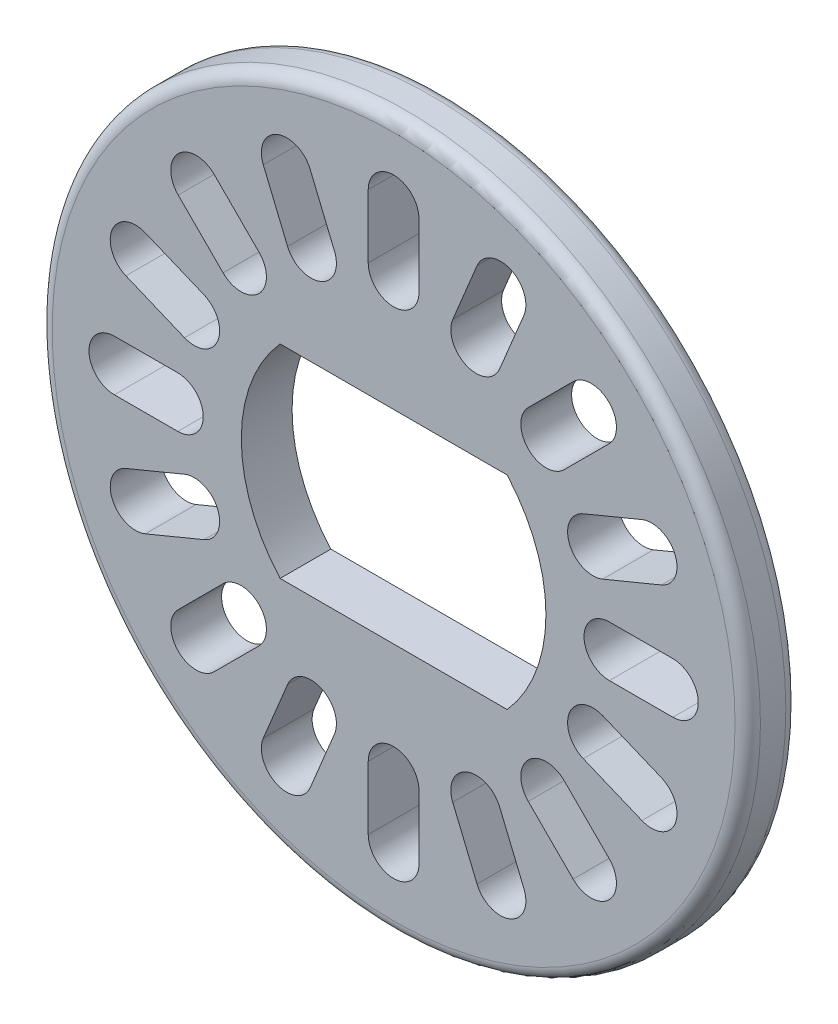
ISO-10303-21;
HEADER;
FILE_DESCRIPTION(('STEP AP214'),'2;1');
FILE_NAME('part.step','',(''),(''),'','','');
FILE_SCHEMA(('AUTOMOTIVE_DESIGN { 1 0 10303 214 1 1 1 1 }'));
ENDSEC;
DATA;
#1=APPLICATION_CONTEXT('core data for automotive mechanical design processes');
#2=APPLICATION_PROTOCOL_DEFINITION('international standard','automotive_design',2000,#1);
#3=PRODUCT_CONTEXT('',#1,'mechanical');
#4=PRODUCT('Part','Part','',(#3));
#5=PRODUCT_RELATED_PRODUCT_CATEGORY('part','',(#4));
#6=PRODUCT_DEFINITION_FORMATION('','',#4);
#7=PRODUCT_DEFINITION_CONTEXT('part definition',#1,'design');
#8=PRODUCT_DEFINITION('design','',#6,#7);
#9=PRODUCT_DEFINITION_SHAPE('','',#8);
#10=(LENGTH_UNIT() NAMED_UNIT(*) SI_UNIT(.MILLI.,.METRE.));
#11=(NAMED_UNIT(*) PLANE_ANGLE_UNIT() SI_UNIT($,.RADIAN.));
#12=(NAMED_UNIT(*) SI_UNIT($,.STERADIAN.) SOLID_ANGLE_UNIT());
#13=UNCERTAINTY_MEASURE_WITH_UNIT(LENGTH_MEASURE(1.E-05),#10,'distance_accuracy_value','');
#14=(GEOMETRIC_REPRESENTATION_CONTEXT(3) GLOBAL_UNCERTAINTY_ASSIGNED_CONTEXT((#13)) GLOBAL_UNIT_ASSIGNED_CONTEXT((#10,
#11,#12)) REPRESENTATION_CONTEXT('',''));
#15=CARTESIAN_POINT('',(0.,0.,0.));
#16=DIRECTION('',(0.,0.,1.));
#17=DIRECTION('',(1.,0.,0.));
#18=AXIS2_PLACEMENT_3D('',#15,#16,#17);
#19=CARTESIAN_POINT('',(0.,0.,2.));
#20=DIRECTION('',(0.,0.,-1.));
#21=DIRECTION('',(-1.,0.,0.));
#22=AXIS2_PLACEMENT_3D('',#19,#20,#21);
#23=CYLINDRICAL_SURFACE('',#22,13.95);
#24=CARTESIAN_POINT('',(0.,0.,0.5));
#25=DIRECTION('',(0.,0.,1.));
#26=DIRECTION('',(1.,0.,0.));
#27=AXIS2_PLACEMENT_3D('',#24,#25,#26);
#28=CIRCLE('',#27,13.95);
#29=CARTESIAN_POINT('',(13.95,0.,0.5));
#30=VERTEX_POINT('',#29);
#31=EDGE_CURVE('E1328',#30,#30,#28,.T.);
#32=ORIENTED_EDGE('',*,*,#31,.T.);
#33=EDGE_LOOP('',(#32));
#34=FACE_BOUND('',#33,.T.);
#35=CARTESIAN_POINT('',(0.,0.,1.5));
#36=DIRECTION('',(0.,0.,1.));
#37=DIRECTION('',(1.,0.,0.));
#38=AXIS2_PLACEMENT_3D('',#35,#36,#37);
#39=CIRCLE('',#38,13.95);
#40=CARTESIAN_POINT('',(13.95,0.,1.5));
#41=VERTEX_POINT('',#40);
#42=EDGE_CURVE('E1319',#41,#41,#39,.F.);
#43=ORIENTED_EDGE('',*,*,#42,.T.);
#44=EDGE_LOOP('',(#43));
#45=FACE_BOUND('',#44,.T.);
#46=ADVANCED_FACE('F353',(#34,#45),#23,.T.);
#47=CARTESIAN_POINT('',(0.,0.,2.));
#48=DIRECTION('',(0.,0.,1.));
#49=DIRECTION('',(1.,0.,0.));
#50=AXIS2_PLACEMENT_3D('',#47,#48,#49);
#51=PLANE('',#50);
#52=CARTESIAN_POINT('',(0.,0.,2.));
#53=DIRECTION('',(0.,0.,1.));
#54=DIRECTION('',(1.,0.,0.));
#55=AXIS2_PLACEMENT_3D('',#52,#53,#54);
#56=CIRCLE('',#55,6.);
#57=CARTESIAN_POINT('',(-4.47213595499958,4.,2.));
#58=VERTEX_POINT('',#57);
#59=CARTESIAN_POINT('',(-4.47213595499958,-4.,2.));
#60=VERTEX_POINT('',#59);
#61=EDGE_CURVE('E367',#58,#60,#56,.T.);
#62=ORIENTED_EDGE('',*,*,#61,.F.);
#63=DIRECTION('',(-1.,0.,0.));
#64=VECTOR('',#63,1.);
#65=CARTESIAN_POINT('',(4.47213595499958,4.,2.));
#66=LINE('',#65,#64);
#67=CARTESIAN_POINT('',(4.47213595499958,4.,2.));
#68=VERTEX_POINT('',#67);
#69=EDGE_CURVE('E795',#68,#58,#66,.T.);
#70=ORIENTED_EDGE('',*,*,#69,.F.);
#71=CARTESIAN_POINT('',(0.,0.,2.));
#72=DIRECTION('',(0.,0.,1.));
#73=DIRECTION('',(1.,0.,0.));
#74=AXIS2_PLACEMENT_3D('',#71,#72,#73);
#75=CIRCLE('',#74,6.);
#76=CARTESIAN_POINT('',(4.47213595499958,-4.,2.));
#77=VERTEX_POINT('',#76);
#78=EDGE_CURVE('E779',#77,#68,#75,.T.);
#79=ORIENTED_EDGE('',*,*,#78,.F.);
#80=DIRECTION('',(1.,0.,0.));
#81=VECTOR('',#80,1.);
#82=CARTESIAN_POINT('',(-4.47213595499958,-4.,2.));
#83=LINE('',#82,#81);
#84=EDGE_CURVE('E788',#60,#77,#83,.T.);
#85=ORIENTED_EDGE('',*,*,#84,.F.);
#86=EDGE_LOOP('',(#62,#70,#79,#85));
#87=FACE_BOUND('',#86,.T.);
#88=CARTESIAN_POINT('',(-4.20951775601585,10.1626748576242,2.));
#89=DIRECTION('',(0.,0.,-1.));
#90=DIRECTION('',(0.923879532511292,0.382683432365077,0.));
#91=AXIS2_PLACEMENT_3D('',#88,#89,#90);
#92=CIRCLE('',#91,1.);
#93=CARTESIAN_POINT('',(-5.13339728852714,9.77999142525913,2.));
#94=VERTEX_POINT('',#93);
#95=CARTESIAN_POINT('',(-3.28563822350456,10.5453582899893,2.));
#96=VERTEX_POINT('',#95);
#97=EDGE_CURVE('E824',#94,#96,#92,.T.);
#98=ORIENTED_EDGE('',*,*,#97,.T.);
#99=DIRECTION('',(0.382683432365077,-0.923879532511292,0.));
#100=VECTOR('',#99,1.);
#101=CARTESIAN_POINT('',(-3.28563822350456,10.5453582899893,2.));
#102=LINE('',#101,#100);
#103=CARTESIAN_POINT('',(-2.32892964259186,8.23565945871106,2.));
#104=VERTEX_POINT('',#103);
#105=EDGE_CURVE('E827',#96,#104,#102,.T.);
#106=ORIENTED_EDGE('',*,*,#105,.T.);
#107=CARTESIAN_POINT('',(-3.25280917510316,7.85297602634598,2.));
#108=DIRECTION('',(0.,0.,-1.));
#109=DIRECTION('',(-0.923879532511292,-0.382683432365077,0.));
#110=AXIS2_PLACEMENT_3D('',#107,#108,#109);
#111=CIRCLE('',#110,1.);
#112=CARTESIAN_POINT('',(-4.17668870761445,7.4702925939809,2.));
#113=VERTEX_POINT('',#112);
#114=EDGE_CURVE('E830',#104,#113,#111,.T.);
#115=ORIENTED_EDGE('',*,*,#114,.T.);
#116=DIRECTION('',(-0.382683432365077,0.923879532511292,0.));
#117=VECTOR('',#116,1.);
#118=CARTESIAN_POINT('',(-5.13339728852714,9.77999142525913,2.));
#119=LINE('',#118,#117);
#120=EDGE_CURVE('E833',#113,#94,#119,.T.);
#121=ORIENTED_EDGE('',*,*,#120,.T.);
#122=EDGE_LOOP('',(#98,#106,#115,#121));
#123=FACE_BOUND('',#122,.T.);
#124=CARTESIAN_POINT('',(-7.77817459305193,7.77817459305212,2.));
#125=DIRECTION('',(0.,0.,-1.));
#126=DIRECTION('',(0.707106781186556,0.707106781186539,0.));
#127=AXIS2_PLACEMENT_3D('',#124,#125,#126);
#128=CIRCLE('',#127,1.);
#129=CARTESIAN_POINT('',(-8.48528137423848,7.07106781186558,2.));
#130=VERTEX_POINT('',#129);
#131=CARTESIAN_POINT('',(-7.07106781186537,8.48528137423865,2.));
#132=VERTEX_POINT('',#131);
#133=EDGE_CURVE('E856',#130,#132,#128,.T.);
#134=ORIENTED_EDGE('',*,*,#133,.T.);
#135=DIRECTION('',(0.707106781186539,-0.707106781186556,0.));
#136=VECTOR('',#135,1.);
#137=CARTESIAN_POINT('',(-7.07106781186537,8.48528137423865,2.));
#138=LINE('',#137,#136);
#139=CARTESIAN_POINT('',(-5.30330085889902,6.71751442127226,2.));
#140=VERTEX_POINT('',#139);
#141=EDGE_CURVE('E859',#132,#140,#138,.T.);
#142=ORIENTED_EDGE('',*,*,#141,.T.);
#143=CARTESIAN_POINT('',(-6.01040764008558,6.01040764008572,2.));
#144=DIRECTION('',(0.,0.,-1.));
#145=DIRECTION('',(-0.707106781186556,-0.707106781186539,0.));
#146=AXIS2_PLACEMENT_3D('',#143,#144,#145);
#147=CIRCLE('',#146,1.);
#148=CARTESIAN_POINT('',(-6.71751442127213,5.30330085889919,2.));
#149=VERTEX_POINT('',#148);
#150=EDGE_CURVE('E862',#140,#149,#147,.T.);
#151=ORIENTED_EDGE('',*,*,#150,.T.);
#152=DIRECTION('',(-0.707106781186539,0.707106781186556,0.));
#153=VECTOR('',#152,1.);
#154=CARTESIAN_POINT('',(-8.48528137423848,7.07106781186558,2.));
#155=LINE('',#154,#153);
#156=EDGE_CURVE('E865',#149,#130,#155,.T.);
#157=ORIENTED_EDGE('',*,*,#156,.T.);
#158=EDGE_LOOP('',(#134,#142,#151,#157));
#159=FACE_BOUND('',#158,.T.);
#160=CARTESIAN_POINT('',(-10.1626748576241,4.2095177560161,2.));
#161=DIRECTION('',(0.,0.,-1.));
#162=DIRECTION('',(0.3826834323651,0.923879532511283,0.));
#163=AXIS2_PLACEMENT_3D('',#160,#161,#162);
#164=CIRCLE('',#163,1.);
#165=CARTESIAN_POINT('',(-10.5453582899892,3.28563822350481,2.));
#166=VERTEX_POINT('',#165);
#167=CARTESIAN_POINT('',(-9.77999142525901,5.13339728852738,2.));
#168=VERTEX_POINT('',#167);
#169=EDGE_CURVE('E888',#166,#168,#164,.T.);
#170=ORIENTED_EDGE('',*,*,#169,.T.);
#171=DIRECTION('',(0.923879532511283,-0.3826834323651,0.));
#172=VECTOR('',#171,1.);
#173=CARTESIAN_POINT('',(-9.77999142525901,5.13339728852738,2.));
#174=LINE('',#173,#172);
#175=CARTESIAN_POINT('',(-7.4702925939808,4.17668870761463,2.));
#176=VERTEX_POINT('',#175);
#177=EDGE_CURVE('E891',#168,#176,#174,.T.);
#178=ORIENTED_EDGE('',*,*,#177,.T.);
#179=CARTESIAN_POINT('',(-7.8529760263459,3.25280917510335,2.));
#180=DIRECTION('',(0.,0.,-1.));
#181=DIRECTION('',(-0.3826834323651,-0.923879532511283,0.));
#182=AXIS2_PLACEMENT_3D('',#179,#180,#181);
#183=CIRCLE('',#182,1.);
#184=CARTESIAN_POINT('',(-8.235659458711,2.32892964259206,2.));
#185=VERTEX_POINT('',#184);
#186=EDGE_CURVE('E894',#176,#185,#183,.T.);
#187=ORIENTED_EDGE('',*,*,#186,.T.);
#188=DIRECTION('',(-0.923879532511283,0.3826834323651,0.));
#189=VECTOR('',#188,1.);
#190=CARTESIAN_POINT('',(-10.5453582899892,3.28563822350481,2.));
#191=LINE('',#190,#189);
#192=EDGE_CURVE('E897',#185,#166,#191,.T.);
#193=ORIENTED_EDGE('',*,*,#192,.T.);
#194=EDGE_LOOP('',(#170,#178,#187,#193));
#195=FACE_BOUND('',#194,.T.);
#196=CARTESIAN_POINT('',(-11.,1.1521895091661E-13,2.));
#197=DIRECTION('',(0.,0.,-1.));
#198=DIRECTION('',(0.,1.,0.));
#199=AXIS2_PLACEMENT_3D('',#196,#197,#198);
#200=CIRCLE('',#199,1.);
#201=CARTESIAN_POINT('',(-11.,-0.999999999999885,2.));
#202=VERTEX_POINT('',#201);
#203=CARTESIAN_POINT('',(-11.,1.00000000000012,2.));
#204=VERTEX_POINT('',#203);
#205=EDGE_CURVE('E920',#202,#204,#200,.T.);
#206=ORIENTED_EDGE('',*,*,#205,.T.);
#207=DIRECTION('',(1.,0.,0.));
#208=VECTOR('',#207,1.);
#209=CARTESIAN_POINT('',(-11.,1.00000000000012,2.));
#210=LINE('',#209,#208);
#211=CARTESIAN_POINT('',(-8.49999999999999,1.00000000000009,2.));
#212=VERTEX_POINT('',#211);
#213=EDGE_CURVE('E923',#204,#212,#210,.T.);
#214=ORIENTED_EDGE('',*,*,#213,.T.);
#215=CARTESIAN_POINT('',(-8.5,0.,2.));
#216=DIRECTION('',(0.,0.,-1.));
#217=DIRECTION('',(0.,-1.,0.));
#218=AXIS2_PLACEMENT_3D('',#215,#216,#217);
#219=CIRCLE('',#218,1.);
#220=CARTESIAN_POINT('',(-8.50000000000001,-0.999999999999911,2.));
#221=VERTEX_POINT('',#220);
#222=EDGE_CURVE('E926',#212,#221,#219,.T.);
#223=ORIENTED_EDGE('',*,*,#222,.T.);
#224=DIRECTION('',(-1.,0.,0.));
#225=VECTOR('',#224,1.);
#226=CARTESIAN_POINT('',(-11.,-0.999999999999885,2.));
#227=LINE('',#226,#225);
#228=EDGE_CURVE('E929',#221,#202,#227,.T.);
#229=ORIENTED_EDGE('',*,*,#228,.T.);
#230=EDGE_LOOP('',(#206,#214,#223,#229));
#231=FACE_BOUND('',#230,.T.);
#232=CARTESIAN_POINT('',(-10.1626748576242,-4.20951775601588,2.));
#233=DIRECTION('',(0.,0.,-1.));
#234=DIRECTION('',(-0.382683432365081,0.923879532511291,0.));
#235=AXIS2_PLACEMENT_3D('',#232,#233,#234);
#236=CIRCLE('',#235,1.);
#237=CARTESIAN_POINT('',(-9.77999142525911,-5.13339728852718,2.));
#238=VERTEX_POINT('',#237);
#239=CARTESIAN_POINT('',(-10.5453582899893,-3.28563822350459,2.));
#240=VERTEX_POINT('',#239);
#241=EDGE_CURVE('E952',#238,#240,#236,.T.);
#242=ORIENTED_EDGE('',*,*,#241,.T.);
#243=DIRECTION('',(0.923879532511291,0.382683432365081,0.));
#244=VECTOR('',#243,1.);
#245=CARTESIAN_POINT('',(-10.5453582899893,-3.28563822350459,2.));
#246=LINE('',#245,#244);
#247=CARTESIAN_POINT('',(-8.23565945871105,-2.32892964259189,2.));
#248=VERTEX_POINT('',#247);
#249=EDGE_CURVE('E955',#240,#248,#246,.T.);
#250=ORIENTED_EDGE('',*,*,#249,.T.);
#251=CARTESIAN_POINT('',(-7.85297602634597,-3.25280917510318,2.));
#252=DIRECTION('',(0.,0.,-1.));
#253=DIRECTION('',(0.382683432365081,-0.923879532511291,0.));
#254=AXIS2_PLACEMENT_3D('',#251,#252,#253);
#255=CIRCLE('',#254,1.);
#256=CARTESIAN_POINT('',(-7.47029259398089,-4.17668870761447,2.));
#257=VERTEX_POINT('',#256);
#258=EDGE_CURVE('E958',#248,#257,#255,.T.);
#259=ORIENTED_EDGE('',*,*,#258,.T.);
#260=DIRECTION('',(-0.923879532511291,-0.38268343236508,0.));
#261=VECTOR('',#260,1.);
#262=CARTESIAN_POINT('',(-9.77999142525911,-5.13339728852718,2.));
#263=LINE('',#262,#261);
#264=EDGE_CURVE('E961',#257,#238,#263,.T.);
#265=ORIENTED_EDGE('',*,*,#264,.T.);
#266=EDGE_LOOP('',(#242,#250,#259,#265));
#267=FACE_BOUND('',#266,.T.);
#268=CARTESIAN_POINT('',(-7.77817459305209,-7.77817459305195,2.));
#269=DIRECTION('',(0.,0.,-1.));
#270=DIRECTION('',(-0.707106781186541,0.707106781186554,0.));
#271=AXIS2_PLACEMENT_3D('',#268,#269,#270);
#272=CIRCLE('',#271,1.);
#273=CARTESIAN_POINT('',(-7.07106781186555,-8.48528137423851,2.));
#274=VERTEX_POINT('',#273);
#275=CARTESIAN_POINT('',(-8.48528137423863,-7.0710678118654,2.));
#276=VERTEX_POINT('',#275);
#277=EDGE_CURVE('E984',#274,#276,#272,.T.);
#278=ORIENTED_EDGE('',*,*,#277,.T.);
#279=DIRECTION('',(0.707106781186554,0.707106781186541,0.));
#280=VECTOR('',#279,1.);
#281=CARTESIAN_POINT('',(-8.48528137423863,-7.0710678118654,2.));
#282=LINE('',#281,#280);
#283=CARTESIAN_POINT('',(-6.71751442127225,-5.30330085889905,2.));
#284=VERTEX_POINT('',#283);
#285=EDGE_CURVE('E987',#276,#284,#282,.T.);
#286=ORIENTED_EDGE('',*,*,#285,.T.);
#287=CARTESIAN_POINT('',(-6.0104076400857,-6.0104076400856,2.));
#288=DIRECTION('',(0.,0.,-1.));
#289=DIRECTION('',(0.707106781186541,-0.707106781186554,0.));
#290=AXIS2_PLACEMENT_3D('',#287,#288,#289);
#291=CIRCLE('',#290,1.);
#292=CARTESIAN_POINT('',(-5.30330085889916,-6.71751442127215,2.));
#293=VERTEX_POINT('',#292);
#294=EDGE_CURVE('E990',#284,#293,#291,.T.);
#295=ORIENTED_EDGE('',*,*,#294,.T.);
#296=DIRECTION('',(-0.707106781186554,-0.707106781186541,0.));
#297=VECTOR('',#296,1.);
#298=CARTESIAN_POINT('',(-7.07106781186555,-8.48528137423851,2.));
#299=LINE('',#298,#297);
#300=EDGE_CURVE('E993',#293,#274,#299,.T.);
#301=ORIENTED_EDGE('',*,*,#300,.T.);
#302=EDGE_LOOP('',(#278,#286,#295,#301));
#303=FACE_BOUND('',#302,.T.);
#304=CARTESIAN_POINT('',(-4.20951775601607,-10.1626748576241,2.));
#305=DIRECTION('',(0.,0.,-1.));
#306=DIRECTION('',(-0.923879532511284,0.382683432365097,0.));
#307=AXIS2_PLACEMENT_3D('',#304,#305,#306);
#308=CIRCLE('',#307,1.);
#309=CARTESIAN_POINT('',(-3.28563822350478,-10.5453582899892,2.));
#310=VERTEX_POINT('',#309);
#311=CARTESIAN_POINT('',(-5.13339728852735,-9.77999142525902,2.));
#312=VERTEX_POINT('',#311);
#313=EDGE_CURVE('E1016',#310,#312,#308,.T.);
#314=ORIENTED_EDGE('',*,*,#313,.T.);
#315=DIRECTION('',(0.382683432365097,0.923879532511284,0.));
#316=VECTOR('',#315,1.);
#317=CARTESIAN_POINT('',(-5.13339728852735,-9.77999142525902,2.));
#318=LINE('',#317,#316);
#319=CARTESIAN_POINT('',(-4.17668870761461,-7.47029259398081,2.));
#320=VERTEX_POINT('',#319);
#321=EDGE_CURVE('E1019',#312,#320,#318,.T.);
#322=ORIENTED_EDGE('',*,*,#321,.T.);
#323=CARTESIAN_POINT('',(-3.25280917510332,-7.85297602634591,2.));
#324=DIRECTION('',(0.,0.,-1.));
#325=DIRECTION('',(0.923879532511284,-0.382683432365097,0.));
#326=AXIS2_PLACEMENT_3D('',#323,#324,#325);
#327=CIRCLE('',#326,1.);
#328=CARTESIAN_POINT('',(-2.32892964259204,-8.23565945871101,2.));
#329=VERTEX_POINT('',#328);
#330=EDGE_CURVE('E1022',#320,#329,#327,.T.);
#331=ORIENTED_EDGE('',*,*,#330,.T.);
#332=DIRECTION('',(-0.382683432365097,-0.923879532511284,0.));
#333=VECTOR('',#332,1.);
#334=CARTESIAN_POINT('',(-3.28563822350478,-10.5453582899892,2.));
#335=LINE('',#334,#333);
#336=EDGE_CURVE('E1025',#329,#310,#335,.T.);
#337=ORIENTED_EDGE('',*,*,#336,.T.);
#338=EDGE_LOOP('',(#314,#322,#331,#337));
#339=FACE_BOUND('',#338,.T.);
#340=CARTESIAN_POINT('',(0.,-11.,2.));
#341=DIRECTION('',(0.,0.,-1.));
#342=DIRECTION('',(-1.,0.,0.));
#343=AXIS2_PLACEMENT_3D('',#340,#341,#342);
#344=CIRCLE('',#343,1.);
#345=CARTESIAN_POINT('',(0.999999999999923,-11.,2.));
#346=VERTEX_POINT('',#345);
#347=CARTESIAN_POINT('',(-1.00000000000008,-11.,2.));
#348=VERTEX_POINT('',#347);
#349=EDGE_CURVE('E1048',#346,#348,#344,.T.);
#350=ORIENTED_EDGE('',*,*,#349,.T.);
#351=DIRECTION('',(0.,1.,0.));
#352=VECTOR('',#351,1.);
#353=CARTESIAN_POINT('',(-1.00000000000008,-11.,2.));
#354=LINE('',#353,#352);
#355=CARTESIAN_POINT('',(-1.00000000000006,-8.49999999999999,2.));
#356=VERTEX_POINT('',#355);
#357=EDGE_CURVE('E1051',#348,#356,#354,.T.);
#358=ORIENTED_EDGE('',*,*,#357,.T.);
#359=CARTESIAN_POINT('',(0.,-8.5,2.));
#360=DIRECTION('',(0.,0.,-1.));
#361=DIRECTION('',(1.,0.,0.));
#362=AXIS2_PLACEMENT_3D('',#359,#360,#361);
#363=CIRCLE('',#362,1.);
#364=CARTESIAN_POINT('',(0.999999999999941,-8.5,2.));
#365=VERTEX_POINT('',#364);
#366=EDGE_CURVE('E1054',#356,#365,#363,.T.);
#367=ORIENTED_EDGE('',*,*,#366,.T.);
#368=DIRECTION('',(0.,-1.,0.));
#369=VECTOR('',#368,1.);
#370=CARTESIAN_POINT('',(0.999999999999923,-11.,2.));
#371=LINE('',#370,#369);
#372=EDGE_CURVE('E1057',#365,#346,#371,.T.);
#373=ORIENTED_EDGE('',*,*,#372,.T.);
#374=EDGE_LOOP('',(#350,#358,#367,#373));
#375=FACE_BOUND('',#374,.T.);
#376=CARTESIAN_POINT('',(4.20951775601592,-10.1626748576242,2.));
#377=DIRECTION('',(0.,0.,-1.));
#378=DIRECTION('',(-0.923879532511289,-0.382683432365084,0.));
#379=AXIS2_PLACEMENT_3D('',#376,#377,#378);
#380=CIRCLE('',#379,1.);
#381=CARTESIAN_POINT('',(5.13339728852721,-9.77999142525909,2.));
#382=VERTEX_POINT('',#381);
#383=CARTESIAN_POINT('',(3.28563822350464,-10.5453582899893,2.));
#384=VERTEX_POINT('',#383);
#385=EDGE_CURVE('E1080',#382,#384,#380,.T.);
#386=ORIENTED_EDGE('',*,*,#385,.T.);
#387=DIRECTION('',(-0.382683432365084,0.923879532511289,0.));
#388=VECTOR('',#387,1.);
#389=CARTESIAN_POINT('',(3.28563822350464,-10.5453582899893,2.));
#390=LINE('',#389,#388);
#391=CARTESIAN_POINT('',(2.32892964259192,-8.23565945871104,2.));
#392=VERTEX_POINT('',#391);
#393=EDGE_CURVE('E1083',#384,#392,#390,.T.);
#394=ORIENTED_EDGE('',*,*,#393,.T.);
#395=CARTESIAN_POINT('',(3.25280917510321,-7.85297602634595,2.));
#396=DIRECTION('',(0.,0.,-1.));
#397=DIRECTION('',(0.923879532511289,0.382683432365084,0.));
#398=AXIS2_PLACEMENT_3D('',#395,#396,#397);
#399=CIRCLE('',#398,1.);
#400=CARTESIAN_POINT('',(4.1766887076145,-7.47029259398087,2.));
#401=VERTEX_POINT('',#400);
#402=EDGE_CURVE('E1086',#392,#401,#399,.T.);
#403=ORIENTED_EDGE('',*,*,#402,.T.);
#404=DIRECTION('',(0.382683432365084,-0.923879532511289,0.));
#405=VECTOR('',#404,1.);
#406=CARTESIAN_POINT('',(5.13339728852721,-9.77999142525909,2.));
#407=LINE('',#406,#405);
#408=EDGE_CURVE('E1089',#401,#382,#407,.T.);
#409=ORIENTED_EDGE('',*,*,#408,.T.);
#410=EDGE_LOOP('',(#386,#394,#403,#409));
#411=FACE_BOUND('',#410,.T.);
#412=CARTESIAN_POINT('',(7.77817459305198,-7.77817459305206,2.));
#413=DIRECTION('',(0.,0.,-1.));
#414=DIRECTION('',(-0.707106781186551,-0.707106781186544,0.));
#415=AXIS2_PLACEMENT_3D('',#412,#413,#414);
#416=CIRCLE('',#415,1.);
#417=CARTESIAN_POINT('',(8.48528137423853,-7.07106781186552,2.));
#418=VERTEX_POINT('',#417);
#419=CARTESIAN_POINT('',(7.07106781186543,-8.48528137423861,2.));
#420=VERTEX_POINT('',#419);
#421=EDGE_CURVE('E1112',#418,#420,#416,.T.);
#422=ORIENTED_EDGE('',*,*,#421,.T.);
#423=DIRECTION('',(-0.707106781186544,0.707106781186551,0.));
#424=VECTOR('',#423,1.);
#425=CARTESIAN_POINT('',(7.07106781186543,-8.48528137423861,2.));
#426=LINE('',#425,#424);
#427=CARTESIAN_POINT('',(5.30330085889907,-6.71751442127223,2.));
#428=VERTEX_POINT('',#427);
#429=EDGE_CURVE('E1115',#420,#428,#426,.T.);
#430=ORIENTED_EDGE('',*,*,#429,.T.);
#431=CARTESIAN_POINT('',(6.01040764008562,-6.01040764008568,2.));
#432=DIRECTION('',(0.,0.,-1.));
#433=DIRECTION('',(0.707106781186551,0.707106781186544,0.));
#434=AXIS2_PLACEMENT_3D('',#431,#432,#433);
#435=CIRCLE('',#434,1.);
#436=CARTESIAN_POINT('',(6.71751442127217,-5.30330085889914,2.));
#437=VERTEX_POINT('',#436);
#438=EDGE_CURVE('E1118',#428,#437,#435,.T.);
#439=ORIENTED_EDGE('',*,*,#438,.T.);
#440=DIRECTION('',(0.707106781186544,-0.707106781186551,0.));
#441=VECTOR('',#440,1.);
#442=CARTESIAN_POINT('',(8.48528137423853,-7.07106781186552,2.));
#443=LINE('',#442,#441);
#444=EDGE_CURVE('E1121',#437,#418,#443,.T.);
#445=ORIENTED_EDGE('',*,*,#444,.T.);
#446=EDGE_LOOP('',(#422,#430,#439,#445));
#447=FACE_BOUND('',#446,.T.);
#448=CARTESIAN_POINT('',(10.1626748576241,-4.20951775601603,2.));
#449=DIRECTION('',(0.,0.,-1.));
#450=DIRECTION('',(-0.382683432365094,-0.923879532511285,0.));
#451=AXIS2_PLACEMENT_3D('',#448,#449,#450);
#452=CIRCLE('',#451,1.);
#453=CARTESIAN_POINT('',(10.5453582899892,-3.28563822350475,2.));
#454=VERTEX_POINT('',#453);
#455=CARTESIAN_POINT('',(9.77999142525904,-5.13339728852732,2.));
#456=VERTEX_POINT('',#455);
#457=EDGE_CURVE('E1144',#454,#456,#452,.T.);
#458=ORIENTED_EDGE('',*,*,#457,.T.);
#459=DIRECTION('',(-0.923879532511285,0.382683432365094,0.));
#460=VECTOR('',#459,1.);
#461=CARTESIAN_POINT('',(9.77999142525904,-5.13339728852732,2.));
#462=LINE('',#461,#460);
#463=CARTESIAN_POINT('',(7.47029259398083,-4.17668870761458,2.));
#464=VERTEX_POINT('',#463);
#465=EDGE_CURVE('E1147',#456,#464,#462,.T.);
#466=ORIENTED_EDGE('',*,*,#465,.T.);
#467=CARTESIAN_POINT('',(7.85297602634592,-3.2528091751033,2.));
#468=DIRECTION('',(0.,0.,-1.));
#469=DIRECTION('',(0.382683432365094,0.923879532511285,0.));
#470=AXIS2_PLACEMENT_3D('',#467,#468,#469);
#471=CIRCLE('',#470,1.);
#472=CARTESIAN_POINT('',(8.23565945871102,-2.32892964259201,2.));
#473=VERTEX_POINT('',#472);
#474=EDGE_CURVE('E1150',#464,#473,#471,.T.);
#475=ORIENTED_EDGE('',*,*,#474,.T.);
#476=DIRECTION('',(0.923879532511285,-0.382683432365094,0.));
#477=VECTOR('',#476,1.);
#478=CARTESIAN_POINT('',(10.5453582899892,-3.28563822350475,2.));
#479=LINE('',#478,#477);
#480=EDGE_CURVE('E1153',#473,#454,#479,.T.);
#481=ORIENTED_EDGE('',*,*,#480,.T.);
#482=EDGE_LOOP('',(#458,#466,#475,#481));
#483=FACE_BOUND('',#482,.T.);
#484=CARTESIAN_POINT('',(11.,0.,2.));
#485=DIRECTION('',(0.,0.,-1.));
#486=DIRECTION('',(0.,-1.,0.));
#487=AXIS2_PLACEMENT_3D('',#484,#485,#486);
#488=CIRCLE('',#487,1.);
#489=CARTESIAN_POINT('',(11.,0.999999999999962,2.));
#490=VERTEX_POINT('',#489);
#491=CARTESIAN_POINT('',(11.,-1.00000000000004,2.));
#492=VERTEX_POINT('',#491);
#493=EDGE_CURVE('E1176',#490,#492,#488,.T.);
#494=ORIENTED_EDGE('',*,*,#493,.T.);
#495=DIRECTION('',(-1.,0.,0.));
#496=VECTOR('',#495,1.);
#497=CARTESIAN_POINT('',(11.,-1.00000000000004,2.));
#498=LINE('',#497,#496);
#499=CARTESIAN_POINT('',(8.49999999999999,-1.00000000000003,2.));
#500=VERTEX_POINT('',#499);
#501=EDGE_CURVE('E1179',#492,#500,#498,.T.);
#502=ORIENTED_EDGE('',*,*,#501,.T.);
#503=CARTESIAN_POINT('',(8.5,0.,2.));
#504=DIRECTION('',(0.,0.,-1.));
#505=DIRECTION('',(0.,1.,0.));
#506=AXIS2_PLACEMENT_3D('',#503,#504,#505);
#507=CIRCLE('',#506,1.);
#508=CARTESIAN_POINT('',(8.5,0.999999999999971,2.));
#509=VERTEX_POINT('',#508);
#510=EDGE_CURVE('E1182',#500,#509,#507,.T.);
#511=ORIENTED_EDGE('',*,*,#510,.T.);
#512=DIRECTION('',(1.,0.,0.));
#513=VECTOR('',#512,1.);
#514=CARTESIAN_POINT('',(11.,0.999999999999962,2.));
#515=LINE('',#514,#513);
#516=EDGE_CURVE('E1185',#509,#490,#515,.T.);
#517=ORIENTED_EDGE('',*,*,#516,.T.);
#518=EDGE_LOOP('',(#494,#502,#511,#517));
#519=FACE_BOUND('',#518,.T.);
#520=CARTESIAN_POINT('',(10.1626748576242,4.20951775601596,2.));
#521=DIRECTION('',(0.,0.,-1.));
#522=DIRECTION('',(0.382683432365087,-0.923879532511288,0.));
#523=AXIS2_PLACEMENT_3D('',#520,#521,#522);
#524=CIRCLE('',#523,1.);
#525=CARTESIAN_POINT('',(9.77999142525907,5.13339728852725,2.));
#526=VERTEX_POINT('',#525);
#527=CARTESIAN_POINT('',(10.5453582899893,3.28563822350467,2.));
#528=VERTEX_POINT('',#527);
#529=EDGE_CURVE('E1208',#526,#528,#524,.T.);
#530=ORIENTED_EDGE('',*,*,#529,.T.);
#531=DIRECTION('',(-0.923879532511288,-0.382683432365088,0.));
#532=VECTOR('',#531,1.);
#533=CARTESIAN_POINT('',(10.5453582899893,3.28563822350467,2.));
#534=LINE('',#533,#532);
#535=CARTESIAN_POINT('',(8.23565945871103,2.32892964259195,2.));
#536=VERTEX_POINT('',#535);
#537=EDGE_CURVE('E1211',#528,#536,#534,.T.);
#538=ORIENTED_EDGE('',*,*,#537,.T.);
#539=CARTESIAN_POINT('',(7.85297602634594,3.25280917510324,2.));
#540=DIRECTION('',(0.,0.,-1.));
#541=DIRECTION('',(-0.382683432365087,0.923879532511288,0.));
#542=AXIS2_PLACEMENT_3D('',#539,#540,#541);
#543=CIRCLE('',#542,1.);
#544=CARTESIAN_POINT('',(7.47029259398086,4.17668870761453,2.));
#545=VERTEX_POINT('',#544);
#546=EDGE_CURVE('E1214',#536,#545,#543,.T.);
#547=ORIENTED_EDGE('',*,*,#546,.T.);
#548=DIRECTION('',(0.923879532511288,0.382683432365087,0.));
#549=VECTOR('',#548,1.);
#550=CARTESIAN_POINT('',(9.77999142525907,5.13339728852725,2.));
#551=LINE('',#550,#549);
#552=EDGE_CURVE('E1217',#545,#526,#551,.T.);
#553=ORIENTED_EDGE('',*,*,#552,.T.);
#554=EDGE_LOOP('',(#530,#538,#547,#553));
#555=FACE_BOUND('',#554,.T.);
#556=CARTESIAN_POINT('',(7.77817459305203,7.77817459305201,2.));
#557=DIRECTION('',(0.,0.,-1.));
#558=DIRECTION('',(0.707106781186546,-0.707106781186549,0.));
#559=AXIS2_PLACEMENT_3D('',#556,#557,#558);
#560=CIRCLE('',#559,1.);
#561=CARTESIAN_POINT('',(7.07106781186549,8.48528137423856,2.));
#562=VERTEX_POINT('',#561);
#563=CARTESIAN_POINT('',(8.48528137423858,7.07106781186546,2.));
#564=VERTEX_POINT('',#563);
#565=EDGE_CURVE('E1240',#562,#564,#560,.T.);
#566=ORIENTED_EDGE('',*,*,#565,.T.);
#567=DIRECTION('',(-0.707106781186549,-0.707106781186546,0.));
#568=VECTOR('',#567,1.);
#569=CARTESIAN_POINT('',(8.48528137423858,7.07106781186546,2.));
#570=LINE('',#569,#568);
#571=CARTESIAN_POINT('',(6.71751442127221,5.30330085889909,2.));
#572=VERTEX_POINT('',#571);
#573=EDGE_CURVE('E1243',#564,#572,#570,.T.);
#574=ORIENTED_EDGE('',*,*,#573,.T.);
#575=CARTESIAN_POINT('',(6.01040764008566,6.01040764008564,2.));
#576=DIRECTION('',(0.,0.,-1.));
#577=DIRECTION('',(-0.707106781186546,0.707106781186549,0.));
#578=AXIS2_PLACEMENT_3D('',#575,#576,#577);
#579=CIRCLE('',#578,1.);
#580=CARTESIAN_POINT('',(5.30330085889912,6.71751442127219,2.));
#581=VERTEX_POINT('',#580);
#582=EDGE_CURVE('E1246',#572,#581,#579,.T.);
#583=ORIENTED_EDGE('',*,*,#582,.T.);
#584=DIRECTION('',(0.707106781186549,0.707106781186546,0.));
#585=VECTOR('',#584,1.);
#586=CARTESIAN_POINT('',(7.07106781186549,8.48528137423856,2.));
#587=LINE('',#586,#585);
#588=EDGE_CURVE('E1249',#581,#562,#587,.T.);
#589=ORIENTED_EDGE('',*,*,#588,.T.);
#590=EDGE_LOOP('',(#566,#574,#583,#589));
#591=FACE_BOUND('',#590,.T.);
#592=CARTESIAN_POINT('',(4.209517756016,10.1626748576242,2.));
#593=DIRECTION('',(0.,0.,-1.));
#594=DIRECTION('',(0.923879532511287,-0.382683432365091,0.));
#595=AXIS2_PLACEMENT_3D('',#592,#593,#594);
#596=CIRCLE('',#595,1.);
#597=CARTESIAN_POINT('',(3.28563822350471,10.5453582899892,2.));
#598=VERTEX_POINT('',#597);
#599=CARTESIAN_POINT('',(5.13339728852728,9.77999142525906,2.));
#600=VERTEX_POINT('',#599);
#601=EDGE_CURVE('E1272',#598,#600,#596,.T.);
#602=ORIENTED_EDGE('',*,*,#601,.T.);
#603=DIRECTION('',(-0.382683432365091,-0.923879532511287,0.));
#604=VECTOR('',#603,1.);
#605=CARTESIAN_POINT('',(5.13339728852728,9.77999142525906,2.));
#606=LINE('',#605,#604);
#607=CARTESIAN_POINT('',(4.17668870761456,7.47029259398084,2.));
#608=VERTEX_POINT('',#607);
#609=EDGE_CURVE('E1275',#600,#608,#606,.T.);
#610=ORIENTED_EDGE('',*,*,#609,.T.);
#611=CARTESIAN_POINT('',(3.25280917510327,7.85297602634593,2.));
#612=DIRECTION('',(0.,0.,-1.));
#613=DIRECTION('',(-0.923879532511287,0.382683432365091,0.));
#614=AXIS2_PLACEMENT_3D('',#611,#612,#613);
#615=CIRCLE('',#614,1.);
#616=CARTESIAN_POINT('',(2.32892964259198,8.23565945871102,2.));
#617=VERTEX_POINT('',#616);
#618=EDGE_CURVE('E1278',#608,#617,#615,.T.);
#619=ORIENTED_EDGE('',*,*,#618,.T.);
#620=DIRECTION('',(0.382683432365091,0.923879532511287,0.));
#621=VECTOR('',#620,1.);
#622=CARTESIAN_POINT('',(3.28563822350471,10.5453582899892,2.));
#623=LINE('',#622,#621);
#624=EDGE_CURVE('E1281',#617,#598,#623,.T.);
#625=ORIENTED_EDGE('',*,*,#624,.T.);
#626=EDGE_LOOP('',(#602,#610,#619,#625));
#627=FACE_BOUND('',#626,.T.);
#628=CARTESIAN_POINT('',(0.,11.,2.));
#629=DIRECTION('',(0.,0.,-1.));
#630=DIRECTION('',(1.,0.,0.));
#631=AXIS2_PLACEMENT_3D('',#628,#629,#630);
#632=CIRCLE('',#631,1.);
#633=CARTESIAN_POINT('',(-1.,11.,2.));
#634=VERTEX_POINT('',#633);
#635=CARTESIAN_POINT('',(1.,11.,2.));
#636=VERTEX_POINT('',#635);
#637=EDGE_CURVE('E1304',#634,#636,#632,.T.);
#638=ORIENTED_EDGE('',*,*,#637,.T.);
#639=DIRECTION('',(0.,-1.,0.));
#640=VECTOR('',#639,1.);
#641=CARTESIAN_POINT('',(1.,11.,2.));
#642=LINE('',#641,#640);
#643=CARTESIAN_POINT('',(1.,8.5,2.));
#644=VERTEX_POINT('',#643);
#645=EDGE_CURVE('E1307',#636,#644,#642,.T.);
#646=ORIENTED_EDGE('',*,*,#645,.T.);
#647=CARTESIAN_POINT('',(0.,8.5,2.));
#648=DIRECTION('',(0.,0.,-1.));
#649=DIRECTION('',(-1.,0.,0.));
#650=AXIS2_PLACEMENT_3D('',#647,#648,#649);
#651=CIRCLE('',#650,1.);
#652=CARTESIAN_POINT('',(-1.,8.5,2.));
#653=VERTEX_POINT('',#652);
#654=EDGE_CURVE('E1310',#644,#653,#651,.T.);
#655=ORIENTED_EDGE('',*,*,#654,.T.);
#656=DIRECTION('',(0.,1.,0.));
#657=VECTOR('',#656,1.);
#658=CARTESIAN_POINT('',(-1.,11.,2.));
#659=LINE('',#658,#657);
#660=EDGE_CURVE('E1313',#653,#634,#659,.T.);
#661=ORIENTED_EDGE('',*,*,#660,.T.);
#662=EDGE_LOOP('',(#638,#646,#655,#661));
#663=FACE_BOUND('',#662,.T.);
#664=CARTESIAN_POINT('',(0.,0.,2.));
#665=DIRECTION('',(0.,0.,1.));
#666=DIRECTION('',(1.,0.,0.));
#667=AXIS2_PLACEMENT_3D('',#664,#665,#666);
#668=CIRCLE('',#667,13.45);
#669=CARTESIAN_POINT('',(13.45,0.,2.));
#670=VERTEX_POINT('',#669);
#671=EDGE_CURVE('E11',#670,#670,#668,.T.);
#672=ORIENTED_EDGE('',*,*,#671,.T.);
#673=EDGE_LOOP('',(#672));
#674=FACE_BOUND('',#673,.T.);
#675=ADVANCED_FACE('F792',(#87,#123,#159,#195,#231,#267,#303,#339,#375,#411,#447,#483,#519,#555,
#591,#627,#663,#674),#51,.T.);
#676=CARTESIAN_POINT('',(0.,0.,0.));
#677=DIRECTION('',(0.,0.,1.));
#678=DIRECTION('',(1.,0.,0.));
#679=AXIS2_PLACEMENT_3D('',#676,#677,#678);
#680=PLANE('',#679);
#681=DIRECTION('',(-1.,0.,0.));
#682=VECTOR('',#681,1.);
#683=CARTESIAN_POINT('',(4.47213595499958,4.,0.));
#684=LINE('',#683,#682);
#685=CARTESIAN_POINT('',(4.47213595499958,4.,0.));
#686=VERTEX_POINT('',#685);
#687=CARTESIAN_POINT('',(-4.47213595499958,4.,0.));
#688=VERTEX_POINT('',#687);
#689=EDGE_CURVE('E806',#686,#688,#684,.T.);
#690=ORIENTED_EDGE('',*,*,#689,.T.);
#691=CARTESIAN_POINT('',(0.,0.,0.));
#692=DIRECTION('',(0.,0.,1.));
#693=DIRECTION('',(1.,0.,0.));
#694=AXIS2_PLACEMENT_3D('',#691,#692,#693);
#695=CIRCLE('',#694,6.);
#696=CARTESIAN_POINT('',(-4.47213595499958,-4.,0.));
#697=VERTEX_POINT('',#696);
#698=EDGE_CURVE('E797',#688,#697,#695,.T.);
#699=ORIENTED_EDGE('',*,*,#698,.T.);
#700=DIRECTION('',(1.,0.,0.));
#701=VECTOR('',#700,1.);
#702=CARTESIAN_POINT('',(-4.47213595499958,-4.,0.));
#703=LINE('',#702,#701);
#704=CARTESIAN_POINT('',(4.47213595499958,-4.,0.));
#705=VERTEX_POINT('',#704);
#706=EDGE_CURVE('E803',#697,#705,#703,.T.);
#707=ORIENTED_EDGE('',*,*,#706,.T.);
#708=CARTESIAN_POINT('',(0.,0.,0.));
#709=DIRECTION('',(0.,0.,1.));
#710=DIRECTION('',(1.,0.,0.));
#711=AXIS2_PLACEMENT_3D('',#708,#709,#710);
#712=CIRCLE('',#711,6.);
#713=EDGE_CURVE('E375',#705,#686,#712,.T.);
#714=ORIENTED_EDGE('',*,*,#713,.T.);
#715=EDGE_LOOP('',(#690,#699,#707,#714));
#716=FACE_BOUND('',#715,.T.);
#717=DIRECTION('',(0.382683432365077,-0.923879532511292,0.));
#718=VECTOR('',#717,1.);
#719=CARTESIAN_POINT('',(-3.28563822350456,10.5453582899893,0.));
#720=LINE('',#719,#718);
#721=CARTESIAN_POINT('',(-3.28563822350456,10.5453582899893,0.));
#722=VERTEX_POINT('',#721);
#723=CARTESIAN_POINT('',(-2.32892964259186,8.23565945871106,0.));
#724=VERTEX_POINT('',#723);
#725=EDGE_CURVE('E815',#722,#724,#720,.T.);
#726=ORIENTED_EDGE('',*,*,#725,.F.);
#727=CARTESIAN_POINT('',(-4.20951775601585,10.1626748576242,0.));
#728=DIRECTION('',(0.,0.,-1.));
#729=DIRECTION('',(0.923879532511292,0.382683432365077,0.));
#730=AXIS2_PLACEMENT_3D('',#727,#728,#729);
#731=CIRCLE('',#730,1.);
#732=CARTESIAN_POINT('',(-5.13339728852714,9.77999142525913,0.));
#733=VERTEX_POINT('',#732);
#734=EDGE_CURVE('E811',#733,#722,#731,.T.);
#735=ORIENTED_EDGE('',*,*,#734,.F.);
#736=DIRECTION('',(-0.382683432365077,0.923879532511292,0.));
#737=VECTOR('',#736,1.);
#738=CARTESIAN_POINT('',(-5.13339728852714,9.77999142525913,0.));
#739=LINE('',#738,#737);
#740=CARTESIAN_POINT('',(-4.17668870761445,7.4702925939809,0.));
#741=VERTEX_POINT('',#740);
#742=EDGE_CURVE('E821',#741,#733,#739,.T.);
#743=ORIENTED_EDGE('',*,*,#742,.F.);
#744=CARTESIAN_POINT('',(-3.25280917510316,7.85297602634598,0.));
#745=DIRECTION('',(0.,0.,-1.));
#746=DIRECTION('',(-0.923879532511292,-0.382683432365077,0.));
#747=AXIS2_PLACEMENT_3D('',#744,#745,#746);
#748=CIRCLE('',#747,1.);
#749=EDGE_CURVE('E818',#724,#741,#748,.T.);
#750=ORIENTED_EDGE('',*,*,#749,.F.);
#751=EDGE_LOOP('',(#726,#735,#743,#750));
#752=FACE_BOUND('',#751,.T.);
#753=DIRECTION('',(0.707106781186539,-0.707106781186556,0.));
#754=VECTOR('',#753,1.);
#755=CARTESIAN_POINT('',(-7.07106781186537,8.48528137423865,0.));
#756=LINE('',#755,#754);
#757=CARTESIAN_POINT('',(-7.07106781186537,8.48528137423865,0.));
#758=VERTEX_POINT('',#757);
#759=CARTESIAN_POINT('',(-5.30330085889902,6.71751442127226,0.));
#760=VERTEX_POINT('',#759);
#761=EDGE_CURVE('E847',#758,#760,#756,.T.);
#762=ORIENTED_EDGE('',*,*,#761,.F.);
#763=CARTESIAN_POINT('',(-7.77817459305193,7.77817459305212,0.));
#764=DIRECTION('',(0.,0.,-1.));
#765=DIRECTION('',(0.707106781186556,0.707106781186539,0.));
#766=AXIS2_PLACEMENT_3D('',#763,#764,#765);
#767=CIRCLE('',#766,1.);
#768=CARTESIAN_POINT('',(-8.48528137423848,7.07106781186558,0.));
#769=VERTEX_POINT('',#768);
#770=EDGE_CURVE('E839',#769,#758,#767,.T.);
#771=ORIENTED_EDGE('',*,*,#770,.F.);
#772=DIRECTION('',(-0.707106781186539,0.707106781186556,0.));
#773=VECTOR('',#772,1.);
#774=CARTESIAN_POINT('',(-8.48528137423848,7.07106781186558,0.));
#775=LINE('',#774,#773);
#776=CARTESIAN_POINT('',(-6.71751442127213,5.30330085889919,0.));
#777=VERTEX_POINT('',#776);
#778=EDGE_CURVE('E853',#777,#769,#775,.T.);
#779=ORIENTED_EDGE('',*,*,#778,.F.);
#780=CARTESIAN_POINT('',(-6.01040764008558,6.01040764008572,0.));
#781=DIRECTION('',(0.,0.,-1.));
#782=DIRECTION('',(-0.707106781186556,-0.707106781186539,0.));
#783=AXIS2_PLACEMENT_3D('',#780,#781,#782);
#784=CIRCLE('',#783,1.);
#785=EDGE_CURVE('E850',#760,#777,#784,.T.);
#786=ORIENTED_EDGE('',*,*,#785,.F.);
#787=EDGE_LOOP('',(#762,#771,#779,#786));
#788=FACE_BOUND('',#787,.T.);
#789=DIRECTION('',(0.923879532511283,-0.3826834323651,0.));
#790=VECTOR('',#789,1.);
#791=CARTESIAN_POINT('',(-9.77999142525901,5.13339728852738,0.));
#792=LINE('',#791,#790);
#793=CARTESIAN_POINT('',(-9.77999142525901,5.13339728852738,0.));
#794=VERTEX_POINT('',#793);
#795=CARTESIAN_POINT('',(-7.4702925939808,4.17668870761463,0.));
#796=VERTEX_POINT('',#795);
#797=EDGE_CURVE('E879',#794,#796,#792,.T.);
#798=ORIENTED_EDGE('',*,*,#797,.F.);
#799=CARTESIAN_POINT('',(-10.1626748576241,4.2095177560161,0.));
#800=DIRECTION('',(0.,0.,-1.));
#801=DIRECTION('',(0.3826834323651,0.923879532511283,0.));
#802=AXIS2_PLACEMENT_3D('',#799,#800,#801);
#803=CIRCLE('',#802,1.);
#804=CARTESIAN_POINT('',(-10.5453582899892,3.28563822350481,0.));
#805=VERTEX_POINT('',#804);
#806=EDGE_CURVE('E871',#805,#794,#803,.T.);
#807=ORIENTED_EDGE('',*,*,#806,.F.);
#808=DIRECTION('',(-0.923879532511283,0.3826834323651,0.));
#809=VECTOR('',#808,1.);
#810=CARTESIAN_POINT('',(-10.5453582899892,3.28563822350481,0.));
#811=LINE('',#810,#809);
#812=CARTESIAN_POINT('',(-8.235659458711,2.32892964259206,0.));
#813=VERTEX_POINT('',#812);
#814=EDGE_CURVE('E885',#813,#805,#811,.T.);
#815=ORIENTED_EDGE('',*,*,#814,.F.);
#816=CARTESIAN_POINT('',(-7.8529760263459,3.25280917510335,0.));
#817=DIRECTION('',(0.,0.,-1.));
#818=DIRECTION('',(-0.3826834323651,-0.923879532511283,0.));
#819=AXIS2_PLACEMENT_3D('',#816,#817,#818);
#820=CIRCLE('',#819,1.);
#821=EDGE_CURVE('E882',#796,#813,#820,.T.);
#822=ORIENTED_EDGE('',*,*,#821,.F.);
#823=EDGE_LOOP('',(#798,#807,#815,#822));
#824=FACE_BOUND('',#823,.T.);
#825=DIRECTION('',(1.,0.,0.));
#826=VECTOR('',#825,1.);
#827=CARTESIAN_POINT('',(-11.,1.00000000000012,0.));
#828=LINE('',#827,#826);
#829=CARTESIAN_POINT('',(-11.,1.00000000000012,0.));
#830=VERTEX_POINT('',#829);
#831=CARTESIAN_POINT('',(-8.49999999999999,1.00000000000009,0.));
#832=VERTEX_POINT('',#831);
#833=EDGE_CURVE('E911',#830,#832,#828,.T.);
#834=ORIENTED_EDGE('',*,*,#833,.F.);
#835=CARTESIAN_POINT('',(-11.,1.1521895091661E-13,0.));
#836=DIRECTION('',(0.,0.,-1.));
#837=DIRECTION('',(0.,1.,0.));
#838=AXIS2_PLACEMENT_3D('',#835,#836,#837);
#839=CIRCLE('',#838,1.);
#840=CARTESIAN_POINT('',(-11.,-0.999999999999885,0.));
#841=VERTEX_POINT('',#840);
#842=EDGE_CURVE('E903',#841,#830,#839,.T.);
#843=ORIENTED_EDGE('',*,*,#842,.F.);
#844=DIRECTION('',(-1.,0.,0.));
#845=VECTOR('',#844,1.);
#846=CARTESIAN_POINT('',(-11.,-0.999999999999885,0.));
#847=LINE('',#846,#845);
#848=CARTESIAN_POINT('',(-8.50000000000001,-0.999999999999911,0.));
#849=VERTEX_POINT('',#848);
#850=EDGE_CURVE('E917',#849,#841,#847,.T.);
#851=ORIENTED_EDGE('',*,*,#850,.F.);
#852=CARTESIAN_POINT('',(-8.5,0.,0.));
#853=DIRECTION('',(0.,0.,-1.));
#854=DIRECTION('',(0.,-1.,0.));
#855=AXIS2_PLACEMENT_3D('',#852,#853,#854);
#856=CIRCLE('',#855,1.);
#857=EDGE_CURVE('E914',#832,#849,#856,.T.);
#858=ORIENTED_EDGE('',*,*,#857,.F.);
#859=EDGE_LOOP('',(#834,#843,#851,#858));
#860=FACE_BOUND('',#859,.T.);
#861=DIRECTION('',(0.923879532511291,0.382683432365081,0.));
#862=VECTOR('',#861,1.);
#863=CARTESIAN_POINT('',(-10.5453582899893,-3.28563822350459,0.));
#864=LINE('',#863,#862);
#865=CARTESIAN_POINT('',(-10.5453582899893,-3.28563822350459,0.));
#866=VERTEX_POINT('',#865);
#867=CARTESIAN_POINT('',(-8.23565945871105,-2.32892964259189,0.));
#868=VERTEX_POINT('',#867);
#869=EDGE_CURVE('E943',#866,#868,#864,.T.);
#870=ORIENTED_EDGE('',*,*,#869,.F.);
#871=CARTESIAN_POINT('',(-10.1626748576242,-4.20951775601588,0.));
#872=DIRECTION('',(0.,0.,-1.));
#873=DIRECTION('',(-0.382683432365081,0.923879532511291,0.));
#874=AXIS2_PLACEMENT_3D('',#871,#872,#873);
#875=CIRCLE('',#874,1.);
#876=CARTESIAN_POINT('',(-9.77999142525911,-5.13339728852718,0.));
#877=VERTEX_POINT('',#876);
#878=EDGE_CURVE('E935',#877,#866,#875,.T.);
#879=ORIENTED_EDGE('',*,*,#878,.F.);
#880=DIRECTION('',(-0.923879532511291,-0.38268343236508,0.));
#881=VECTOR('',#880,1.);
#882=CARTESIAN_POINT('',(-9.77999142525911,-5.13339728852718,0.));
#883=LINE('',#882,#881);
#884=CARTESIAN_POINT('',(-7.47029259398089,-4.17668870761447,0.));
#885=VERTEX_POINT('',#884);
#886=EDGE_CURVE('E949',#885,#877,#883,.T.);
#887=ORIENTED_EDGE('',*,*,#886,.F.);
#888=CARTESIAN_POINT('',(-7.85297602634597,-3.25280917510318,0.));
#889=DIRECTION('',(0.,0.,-1.));
#890=DIRECTION('',(0.382683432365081,-0.923879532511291,0.));
#891=AXIS2_PLACEMENT_3D('',#888,#889,#890);
#892=CIRCLE('',#891,1.);
#893=EDGE_CURVE('E946',#868,#885,#892,.T.);
#894=ORIENTED_EDGE('',*,*,#893,.F.);
#895=EDGE_LOOP('',(#870,#879,#887,#894));
#896=FACE_BOUND('',#895,.T.);
#897=DIRECTION('',(0.707106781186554,0.707106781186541,0.));
#898=VECTOR('',#897,1.);
#899=CARTESIAN_POINT('',(-8.48528137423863,-7.0710678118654,0.));
#900=LINE('',#899,#898);
#901=CARTESIAN_POINT('',(-8.48528137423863,-7.0710678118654,0.));
#902=VERTEX_POINT('',#901);
#903=CARTESIAN_POINT('',(-6.71751442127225,-5.30330085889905,0.));
#904=VERTEX_POINT('',#903);
#905=EDGE_CURVE('E975',#902,#904,#900,.T.);
#906=ORIENTED_EDGE('',*,*,#905,.F.);
#907=CARTESIAN_POINT('',(-7.77817459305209,-7.77817459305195,0.));
#908=DIRECTION('',(0.,0.,-1.));
#909=DIRECTION('',(-0.707106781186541,0.707106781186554,0.));
#910=AXIS2_PLACEMENT_3D('',#907,#908,#909);
#911=CIRCLE('',#910,1.);
#912=CARTESIAN_POINT('',(-7.07106781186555,-8.48528137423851,0.));
#913=VERTEX_POINT('',#912);
#914=EDGE_CURVE('E967',#913,#902,#911,.T.);
#915=ORIENTED_EDGE('',*,*,#914,.F.);
#916=DIRECTION('',(-0.707106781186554,-0.707106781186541,0.));
#917=VECTOR('',#916,1.);
#918=CARTESIAN_POINT('',(-7.07106781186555,-8.48528137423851,0.));
#919=LINE('',#918,#917);
#920=CARTESIAN_POINT('',(-5.30330085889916,-6.71751442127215,0.));
#921=VERTEX_POINT('',#920);
#922=EDGE_CURVE('E981',#921,#913,#919,.T.);
#923=ORIENTED_EDGE('',*,*,#922,.F.);
#924=CARTESIAN_POINT('',(-6.0104076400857,-6.0104076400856,0.));
#925=DIRECTION('',(0.,0.,-1.));
#926=DIRECTION('',(0.707106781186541,-0.707106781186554,0.));
#927=AXIS2_PLACEMENT_3D('',#924,#925,#926);
#928=CIRCLE('',#927,1.);
#929=EDGE_CURVE('E978',#904,#921,#928,.T.);
#930=ORIENTED_EDGE('',*,*,#929,.F.);
#931=EDGE_LOOP('',(#906,#915,#923,#930));
#932=FACE_BOUND('',#931,.T.);
#933=DIRECTION('',(0.382683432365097,0.923879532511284,0.));
#934=VECTOR('',#933,1.);
#935=CARTESIAN_POINT('',(-5.13339728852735,-9.77999142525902,0.));
#936=LINE('',#935,#934);
#937=CARTESIAN_POINT('',(-5.13339728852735,-9.77999142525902,0.));
#938=VERTEX_POINT('',#937);
#939=CARTESIAN_POINT('',(-4.17668870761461,-7.47029259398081,0.));
#940=VERTEX_POINT('',#939);
#941=EDGE_CURVE('E1007',#938,#940,#936,.T.);
#942=ORIENTED_EDGE('',*,*,#941,.F.);
#943=CARTESIAN_POINT('',(-4.20951775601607,-10.1626748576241,0.));
#944=DIRECTION('',(0.,0.,-1.));
#945=DIRECTION('',(-0.923879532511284,0.382683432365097,0.));
#946=AXIS2_PLACEMENT_3D('',#943,#944,#945);
#947=CIRCLE('',#946,1.);
#948=CARTESIAN_POINT('',(-3.28563822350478,-10.5453582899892,0.));
#949=VERTEX_POINT('',#948);
#950=EDGE_CURVE('E999',#949,#938,#947,.T.);
#951=ORIENTED_EDGE('',*,*,#950,.F.);
#952=DIRECTION('',(-0.382683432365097,-0.923879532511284,0.));
#953=VECTOR('',#952,1.);
#954=CARTESIAN_POINT('',(-3.28563822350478,-10.5453582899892,0.));
#955=LINE('',#954,#953);
#956=CARTESIAN_POINT('',(-2.32892964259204,-8.23565945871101,0.));
#957=VERTEX_POINT('',#956);
#958=EDGE_CURVE('E1013',#957,#949,#955,.T.);
#959=ORIENTED_EDGE('',*,*,#958,.F.);
#960=CARTESIAN_POINT('',(-3.25280917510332,-7.85297602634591,0.));
#961=DIRECTION('',(0.,0.,-1.));
#962=DIRECTION('',(0.923879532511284,-0.382683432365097,0.));
#963=AXIS2_PLACEMENT_3D('',#960,#961,#962);
#964=CIRCLE('',#963,1.);
#965=EDGE_CURVE('E1010',#940,#957,#964,.T.);
#966=ORIENTED_EDGE('',*,*,#965,.F.);
#967=EDGE_LOOP('',(#942,#951,#959,#966));
#968=FACE_BOUND('',#967,.T.);
#969=DIRECTION('',(0.,1.,0.));
#970=VECTOR('',#969,1.);
#971=CARTESIAN_POINT('',(-1.00000000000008,-11.,0.));
#972=LINE('',#971,#970);
#973=CARTESIAN_POINT('',(-1.00000000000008,-11.,0.));
#974=VERTEX_POINT('',#973);
#975=CARTESIAN_POINT('',(-1.00000000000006,-8.49999999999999,0.));
#976=VERTEX_POINT('',#975);
#977=EDGE_CURVE('E1039',#974,#976,#972,.T.);
#978=ORIENTED_EDGE('',*,*,#977,.F.);
#979=CARTESIAN_POINT('',(0.,-11.,0.));
#980=DIRECTION('',(0.,0.,-1.));
#981=DIRECTION('',(-1.,0.,0.));
#982=AXIS2_PLACEMENT_3D('',#979,#980,#981);
#983=CIRCLE('',#982,1.);
#984=CARTESIAN_POINT('',(0.999999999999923,-11.,0.));
#985=VERTEX_POINT('',#984);
#986=EDGE_CURVE('E1031',#985,#974,#983,.T.);
#987=ORIENTED_EDGE('',*,*,#986,.F.);
#988=DIRECTION('',(0.,-1.,0.));
#989=VECTOR('',#988,1.);
#990=CARTESIAN_POINT('',(0.999999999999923,-11.,0.));
#991=LINE('',#990,#989);
#992=CARTESIAN_POINT('',(0.999999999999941,-8.5,0.));
#993=VERTEX_POINT('',#992);
#994=EDGE_CURVE('E1045',#993,#985,#991,.T.);
#995=ORIENTED_EDGE('',*,*,#994,.F.);
#996=CARTESIAN_POINT('',(0.,-8.5,0.));
#997=DIRECTION('',(0.,0.,-1.));
#998=DIRECTION('',(1.,0.,0.));
#999=AXIS2_PLACEMENT_3D('',#996,#997,#998);
#1000=CIRCLE('',#999,1.);
#1001=EDGE_CURVE('E1042',#976,#993,#1000,.T.);
#1002=ORIENTED_EDGE('',*,*,#1001,.F.);
#1003=EDGE_LOOP('',(#978,#987,#995,#1002));
#1004=FACE_BOUND('',#1003,.T.);
#1005=DIRECTION('',(-0.382683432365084,0.923879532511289,0.));
#1006=VECTOR('',#1005,1.);
#1007=CARTESIAN_POINT('',(3.28563822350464,-10.5453582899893,0.));
#1008=LINE('',#1007,#1006);
#1009=CARTESIAN_POINT('',(3.28563822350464,-10.5453582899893,0.));
#1010=VERTEX_POINT('',#1009);
#1011=CARTESIAN_POINT('',(2.32892964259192,-8.23565945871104,0.));
#1012=VERTEX_POINT('',#1011);
#1013=EDGE_CURVE('E1071',#1010,#1012,#1008,.T.);
#1014=ORIENTED_EDGE('',*,*,#1013,.F.);
#1015=CARTESIAN_POINT('',(4.20951775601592,-10.1626748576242,0.));
#1016=DIRECTION('',(0.,0.,-1.));
#1017=DIRECTION('',(-0.923879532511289,-0.382683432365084,0.));
#1018=AXIS2_PLACEMENT_3D('',#1015,#1016,#1017);
#1019=CIRCLE('',#1018,1.);
#1020=CARTESIAN_POINT('',(5.13339728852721,-9.77999142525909,0.));
#1021=VERTEX_POINT('',#1020);
#1022=EDGE_CURVE('E1063',#1021,#1010,#1019,.T.);
#1023=ORIENTED_EDGE('',*,*,#1022,.F.);
#1024=DIRECTION('',(0.382683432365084,-0.923879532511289,0.));
#1025=VECTOR('',#1024,1.);
#1026=CARTESIAN_POINT('',(5.13339728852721,-9.77999142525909,0.));
#1027=LINE('',#1026,#1025);
#1028=CARTESIAN_POINT('',(4.1766887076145,-7.47029259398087,0.));
#1029=VERTEX_POINT('',#1028);
#1030=EDGE_CURVE('E1077',#1029,#1021,#1027,.T.);
#1031=ORIENTED_EDGE('',*,*,#1030,.F.);
#1032=CARTESIAN_POINT('',(3.25280917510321,-7.85297602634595,0.));
#1033=DIRECTION('',(0.,0.,-1.));
#1034=DIRECTION('',(0.923879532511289,0.382683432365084,0.));
#1035=AXIS2_PLACEMENT_3D('',#1032,#1033,#1034);
#1036=CIRCLE('',#1035,1.);
#1037=EDGE_CURVE('E1074',#1012,#1029,#1036,.T.);
#1038=ORIENTED_EDGE('',*,*,#1037,.F.);
#1039=EDGE_LOOP('',(#1014,#1023,#1031,#1038));
#1040=FACE_BOUND('',#1039,.T.);
#1041=DIRECTION('',(-0.707106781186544,0.707106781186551,0.));
#1042=VECTOR('',#1041,1.);
#1043=CARTESIAN_POINT('',(7.07106781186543,-8.48528137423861,0.));
#1044=LINE('',#1043,#1042);
#1045=CARTESIAN_POINT('',(7.07106781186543,-8.48528137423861,0.));
#1046=VERTEX_POINT('',#1045);
#1047=CARTESIAN_POINT('',(5.30330085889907,-6.71751442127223,0.));
#1048=VERTEX_POINT('',#1047);
#1049=EDGE_CURVE('E1103',#1046,#1048,#1044,.T.);
#1050=ORIENTED_EDGE('',*,*,#1049,.F.);
#1051=CARTESIAN_POINT('',(7.77817459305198,-7.77817459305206,0.));
#1052=DIRECTION('',(0.,0.,-1.));
#1053=DIRECTION('',(-0.707106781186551,-0.707106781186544,0.));
#1054=AXIS2_PLACEMENT_3D('',#1051,#1052,#1053);
#1055=CIRCLE('',#1054,1.);
#1056=CARTESIAN_POINT('',(8.48528137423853,-7.07106781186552,0.));
#1057=VERTEX_POINT('',#1056);
#1058=EDGE_CURVE('E1095',#1057,#1046,#1055,.T.);
#1059=ORIENTED_EDGE('',*,*,#1058,.F.);
#1060=DIRECTION('',(0.707106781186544,-0.707106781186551,0.));
#1061=VECTOR('',#1060,1.);
#1062=CARTESIAN_POINT('',(8.48528137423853,-7.07106781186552,0.));
#1063=LINE('',#1062,#1061);
#1064=CARTESIAN_POINT('',(6.71751442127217,-5.30330085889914,0.));
#1065=VERTEX_POINT('',#1064);
#1066=EDGE_CURVE('E1109',#1065,#1057,#1063,.T.);
#1067=ORIENTED_EDGE('',*,*,#1066,.F.);
#1068=CARTESIAN_POINT('',(6.01040764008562,-6.01040764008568,0.));
#1069=DIRECTION('',(0.,0.,-1.));
#1070=DIRECTION('',(0.707106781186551,0.707106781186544,0.));
#1071=AXIS2_PLACEMENT_3D('',#1068,#1069,#1070);
#1072=CIRCLE('',#1071,1.);
#1073=EDGE_CURVE('E1106',#1048,#1065,#1072,.T.);
#1074=ORIENTED_EDGE('',*,*,#1073,.F.);
#1075=EDGE_LOOP('',(#1050,#1059,#1067,#1074));
#1076=FACE_BOUND('',#1075,.T.);
#1077=DIRECTION('',(-0.923879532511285,0.382683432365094,0.));
#1078=VECTOR('',#1077,1.);
#1079=CARTESIAN_POINT('',(9.77999142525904,-5.13339728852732,0.));
#1080=LINE('',#1079,#1078);
#1081=CARTESIAN_POINT('',(9.77999142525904,-5.13339728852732,0.));
#1082=VERTEX_POINT('',#1081);
#1083=CARTESIAN_POINT('',(7.47029259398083,-4.17668870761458,0.));
#1084=VERTEX_POINT('',#1083);
#1085=EDGE_CURVE('E1135',#1082,#1084,#1080,.T.);
#1086=ORIENTED_EDGE('',*,*,#1085,.F.);
#1087=CARTESIAN_POINT('',(10.1626748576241,-4.20951775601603,0.));
#1088=DIRECTION('',(0.,0.,-1.));
#1089=DIRECTION('',(-0.382683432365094,-0.923879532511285,0.));
#1090=AXIS2_PLACEMENT_3D('',#1087,#1088,#1089);
#1091=CIRCLE('',#1090,1.);
#1092=CARTESIAN_POINT('',(10.5453582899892,-3.28563822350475,0.));
#1093=VERTEX_POINT('',#1092);
#1094=EDGE_CURVE('E1127',#1093,#1082,#1091,.T.);
#1095=ORIENTED_EDGE('',*,*,#1094,.F.);
#1096=DIRECTION('',(0.923879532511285,-0.382683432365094,0.));
#1097=VECTOR('',#1096,1.);
#1098=CARTESIAN_POINT('',(10.5453582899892,-3.28563822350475,0.));
#1099=LINE('',#1098,#1097);
#1100=CARTESIAN_POINT('',(8.23565945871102,-2.32892964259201,0.));
#1101=VERTEX_POINT('',#1100);
#1102=EDGE_CURVE('E1141',#1101,#1093,#1099,.T.);
#1103=ORIENTED_EDGE('',*,*,#1102,.F.);
#1104=CARTESIAN_POINT('',(7.85297602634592,-3.2528091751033,0.));
#1105=DIRECTION('',(0.,0.,-1.));
#1106=DIRECTION('',(0.382683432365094,0.923879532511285,0.));
#1107=AXIS2_PLACEMENT_3D('',#1104,#1105,#1106);
#1108=CIRCLE('',#1107,1.);
#1109=EDGE_CURVE('E1138',#1084,#1101,#1108,.T.);
#1110=ORIENTED_EDGE('',*,*,#1109,.F.);
#1111=EDGE_LOOP('',(#1086,#1095,#1103,#1110));
#1112=FACE_BOUND('',#1111,.T.);
#1113=DIRECTION('',(-1.,0.,0.));
#1114=VECTOR('',#1113,1.);
#1115=CARTESIAN_POINT('',(11.,-1.00000000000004,0.));
#1116=LINE('',#1115,#1114);
#1117=CARTESIAN_POINT('',(11.,-1.00000000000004,0.));
#1118=VERTEX_POINT('',#1117);
#1119=CARTESIAN_POINT('',(8.49999999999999,-1.00000000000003,0.));
#1120=VERTEX_POINT('',#1119);
#1121=EDGE_CURVE('E1167',#1118,#1120,#1116,.T.);
#1122=ORIENTED_EDGE('',*,*,#1121,.F.);
#1123=CARTESIAN_POINT('',(11.,0.,0.));
#1124=DIRECTION('',(0.,0.,-1.));
#1125=DIRECTION('',(0.,-1.,0.));
#1126=AXIS2_PLACEMENT_3D('',#1123,#1124,#1125);
#1127=CIRCLE('',#1126,1.);
#1128=CARTESIAN_POINT('',(11.,0.999999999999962,0.));
#1129=VERTEX_POINT('',#1128);
#1130=EDGE_CURVE('E1159',#1129,#1118,#1127,.T.);
#1131=ORIENTED_EDGE('',*,*,#1130,.F.);
#1132=DIRECTION('',(1.,0.,0.));
#1133=VECTOR('',#1132,1.);
#1134=CARTESIAN_POINT('',(11.,0.999999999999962,0.));
#1135=LINE('',#1134,#1133);
#1136=CARTESIAN_POINT('',(8.5,0.999999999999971,0.));
#1137=VERTEX_POINT('',#1136);
#1138=EDGE_CURVE('E1173',#1137,#1129,#1135,.T.);
#1139=ORIENTED_EDGE('',*,*,#1138,.F.);
#1140=CARTESIAN_POINT('',(8.5,0.,0.));
#1141=DIRECTION('',(0.,0.,-1.));
#1142=DIRECTION('',(0.,1.,0.));
#1143=AXIS2_PLACEMENT_3D('',#1140,#1141,#1142);
#1144=CIRCLE('',#1143,1.);
#1145=EDGE_CURVE('E1170',#1120,#1137,#1144,.T.);
#1146=ORIENTED_EDGE('',*,*,#1145,.F.);
#1147=EDGE_LOOP('',(#1122,#1131,#1139,#1146));
#1148=FACE_BOUND('',#1147,.T.);
#1149=DIRECTION('',(-0.923879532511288,-0.382683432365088,0.));
#1150=VECTOR('',#1149,1.);
#1151=CARTESIAN_POINT('',(10.5453582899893,3.28563822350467,0.));
#1152=LINE('',#1151,#1150);
#1153=CARTESIAN_POINT('',(10.5453582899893,3.28563822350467,0.));
#1154=VERTEX_POINT('',#1153);
#1155=CARTESIAN_POINT('',(8.23565945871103,2.32892964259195,0.));
#1156=VERTEX_POINT('',#1155);
#1157=EDGE_CURVE('E1199',#1154,#1156,#1152,.T.);
#1158=ORIENTED_EDGE('',*,*,#1157,.F.);
#1159=CARTESIAN_POINT('',(10.1626748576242,4.20951775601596,0.));
#1160=DIRECTION('',(0.,0.,-1.));
#1161=DIRECTION('',(0.382683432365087,-0.923879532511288,0.));
#1162=AXIS2_PLACEMENT_3D('',#1159,#1160,#1161);
#1163=CIRCLE('',#1162,1.);
#1164=CARTESIAN_POINT('',(9.77999142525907,5.13339728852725,0.));
#1165=VERTEX_POINT('',#1164);
#1166=EDGE_CURVE('E1191',#1165,#1154,#1163,.T.);
#1167=ORIENTED_EDGE('',*,*,#1166,.F.);
#1168=DIRECTION('',(0.923879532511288,0.382683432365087,0.));
#1169=VECTOR('',#1168,1.);
#1170=CARTESIAN_POINT('',(9.77999142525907,5.13339728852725,0.));
#1171=LINE('',#1170,#1169);
#1172=CARTESIAN_POINT('',(7.47029259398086,4.17668870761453,0.));
#1173=VERTEX_POINT('',#1172);
#1174=EDGE_CURVE('E1205',#1173,#1165,#1171,.T.);
#1175=ORIENTED_EDGE('',*,*,#1174,.F.);
#1176=CARTESIAN_POINT('',(7.85297602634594,3.25280917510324,0.));
#1177=DIRECTION('',(0.,0.,-1.));
#1178=DIRECTION('',(-0.382683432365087,0.923879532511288,0.));
#1179=AXIS2_PLACEMENT_3D('',#1176,#1177,#1178);
#1180=CIRCLE('',#1179,1.);
#1181=EDGE_CURVE('E1202',#1156,#1173,#1180,.T.);
#1182=ORIENTED_EDGE('',*,*,#1181,.F.);
#1183=EDGE_LOOP('',(#1158,#1167,#1175,#1182));
#1184=FACE_BOUND('',#1183,.T.);
#1185=DIRECTION('',(-0.707106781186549,-0.707106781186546,0.));
#1186=VECTOR('',#1185,1.);
#1187=CARTESIAN_POINT('',(8.48528137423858,7.07106781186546,0.));
#1188=LINE('',#1187,#1186);
#1189=CARTESIAN_POINT('',(8.48528137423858,7.07106781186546,0.));
#1190=VERTEX_POINT('',#1189);
#1191=CARTESIAN_POINT('',(6.71751442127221,5.30330085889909,0.));
#1192=VERTEX_POINT('',#1191);
#1193=EDGE_CURVE('E1231',#1190,#1192,#1188,.T.);
#1194=ORIENTED_EDGE('',*,*,#1193,.F.);
#1195=CARTESIAN_POINT('',(7.77817459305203,7.77817459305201,0.));
#1196=DIRECTION('',(0.,0.,-1.));
#1197=DIRECTION('',(0.707106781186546,-0.707106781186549,0.));
#1198=AXIS2_PLACEMENT_3D('',#1195,#1196,#1197);
#1199=CIRCLE('',#1198,1.);
#1200=CARTESIAN_POINT('',(7.07106781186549,8.48528137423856,0.));
#1201=VERTEX_POINT('',#1200);
#1202=EDGE_CURVE('E1223',#1201,#1190,#1199,.T.);
#1203=ORIENTED_EDGE('',*,*,#1202,.F.);
#1204=DIRECTION('',(0.707106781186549,0.707106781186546,0.));
#1205=VECTOR('',#1204,1.);
#1206=CARTESIAN_POINT('',(7.07106781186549,8.48528137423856,0.));
#1207=LINE('',#1206,#1205);
#1208=CARTESIAN_POINT('',(5.30330085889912,6.71751442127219,0.));
#1209=VERTEX_POINT('',#1208);
#1210=EDGE_CURVE('E1237',#1209,#1201,#1207,.T.);
#1211=ORIENTED_EDGE('',*,*,#1210,.F.);
#1212=CARTESIAN_POINT('',(6.01040764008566,6.01040764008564,0.));
#1213=DIRECTION('',(0.,0.,-1.));
#1214=DIRECTION('',(-0.707106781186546,0.707106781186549,0.));
#1215=AXIS2_PLACEMENT_3D('',#1212,#1213,#1214);
#1216=CIRCLE('',#1215,1.);
#1217=EDGE_CURVE('E1234',#1192,#1209,#1216,.T.);
#1218=ORIENTED_EDGE('',*,*,#1217,.F.);
#1219=EDGE_LOOP('',(#1194,#1203,#1211,#1218));
#1220=FACE_BOUND('',#1219,.T.);
#1221=DIRECTION('',(-0.382683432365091,-0.923879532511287,0.));
#1222=VECTOR('',#1221,1.);
#1223=CARTESIAN_POINT('',(5.13339728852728,9.77999142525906,0.));
#1224=LINE('',#1223,#1222);
#1225=CARTESIAN_POINT('',(5.13339728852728,9.77999142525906,0.));
#1226=VERTEX_POINT('',#1225);
#1227=CARTESIAN_POINT('',(4.17668870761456,7.47029259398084,0.));
#1228=VERTEX_POINT('',#1227);
#1229=EDGE_CURVE('E1263',#1226,#1228,#1224,.T.);
#1230=ORIENTED_EDGE('',*,*,#1229,.F.);
#1231=CARTESIAN_POINT('',(4.209517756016,10.1626748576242,0.));
#1232=DIRECTION('',(0.,0.,-1.));
#1233=DIRECTION('',(0.923879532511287,-0.382683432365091,0.));
#1234=AXIS2_PLACEMENT_3D('',#1231,#1232,#1233);
#1235=CIRCLE('',#1234,1.);
#1236=CARTESIAN_POINT('',(3.28563822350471,10.5453582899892,0.));
#1237=VERTEX_POINT('',#1236);
#1238=EDGE_CURVE('E1255',#1237,#1226,#1235,.T.);
#1239=ORIENTED_EDGE('',*,*,#1238,.F.);
#1240=DIRECTION('',(0.382683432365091,0.923879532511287,0.));
#1241=VECTOR('',#1240,1.);
#1242=CARTESIAN_POINT('',(3.28563822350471,10.5453582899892,0.));
#1243=LINE('',#1242,#1241);
#1244=CARTESIAN_POINT('',(2.32892964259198,8.23565945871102,0.));
#1245=VERTEX_POINT('',#1244);
#1246=EDGE_CURVE('E1269',#1245,#1237,#1243,.T.);
#1247=ORIENTED_EDGE('',*,*,#1246,.F.);
#1248=CARTESIAN_POINT('',(3.25280917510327,7.85297602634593,0.));
#1249=DIRECTION('',(0.,0.,-1.));
#1250=DIRECTION('',(-0.923879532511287,0.382683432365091,0.));
#1251=AXIS2_PLACEMENT_3D('',#1248,#1249,#1250);
#1252=CIRCLE('',#1251,1.);
#1253=EDGE_CURVE('E1266',#1228,#1245,#1252,.T.);
#1254=ORIENTED_EDGE('',*,*,#1253,.F.);
#1255=EDGE_LOOP('',(#1230,#1239,#1247,#1254));
#1256=FACE_BOUND('',#1255,.T.);
#1257=DIRECTION('',(0.,-1.,0.));
#1258=VECTOR('',#1257,1.);
#1259=CARTESIAN_POINT('',(1.,11.,0.));
#1260=LINE('',#1259,#1258);
#1261=CARTESIAN_POINT('',(1.,11.,0.));
#1262=VERTEX_POINT('',#1261);
#1263=CARTESIAN_POINT('',(1.,8.5,0.));
#1264=VERTEX_POINT('',#1263);
#1265=EDGE_CURVE('E1295',#1262,#1264,#1260,.T.);
#1266=ORIENTED_EDGE('',*,*,#1265,.F.);
#1267=CARTESIAN_POINT('',(0.,11.,0.));
#1268=DIRECTION('',(0.,0.,-1.));
#1269=DIRECTION('',(1.,0.,0.));
#1270=AXIS2_PLACEMENT_3D('',#1267,#1268,#1269);
#1271=CIRCLE('',#1270,1.);
#1272=CARTESIAN_POINT('',(-1.,11.,0.));
#1273=VERTEX_POINT('',#1272);
#1274=EDGE_CURVE('E1287',#1273,#1262,#1271,.T.);
#1275=ORIENTED_EDGE('',*,*,#1274,.F.);
#1276=DIRECTION('',(0.,1.,0.));
#1277=VECTOR('',#1276,1.);
#1278=CARTESIAN_POINT('',(-1.,11.,0.));
#1279=LINE('',#1278,#1277);
#1280=CARTESIAN_POINT('',(-1.,8.5,0.));
#1281=VERTEX_POINT('',#1280);
#1282=EDGE_CURVE('E1301',#1281,#1273,#1279,.T.);
#1283=ORIENTED_EDGE('',*,*,#1282,.F.);
#1284=CARTESIAN_POINT('',(0.,8.5,0.));
#1285=DIRECTION('',(0.,0.,-1.));
#1286=DIRECTION('',(-1.,0.,0.));
#1287=AXIS2_PLACEMENT_3D('',#1284,#1285,#1286);
#1288=CIRCLE('',#1287,1.);
#1289=EDGE_CURVE('E1298',#1264,#1281,#1288,.T.);
#1290=ORIENTED_EDGE('',*,*,#1289,.F.);
#1291=EDGE_LOOP('',(#1266,#1275,#1283,#1290));
#1292=FACE_BOUND('',#1291,.T.);
#1293=CARTESIAN_POINT('',(0.,0.,0.));
#1294=DIRECTION('',(0.,0.,1.));
#1295=DIRECTION('',(1.,0.,0.));
#1296=AXIS2_PLACEMENT_3D('',#1293,#1294,#1295);
#1297=CIRCLE('',#1296,13.45);
#1298=CARTESIAN_POINT('',(13.45,0.,0.));
#1299=VERTEX_POINT('',#1298);
#1300=EDGE_CURVE('E360',#1299,#1299,#1297,.F.);
#1301=ORIENTED_EDGE('',*,*,#1300,.T.);
#1302=EDGE_LOOP('',(#1301));
#1303=FACE_BOUND('',#1302,.T.);
#1304=ADVANCED_FACE('F1333',(#716,#752,#788,#824,#860,#896,#932,#968,#1004,#1040,#1076,#1112,
#1148,#1184,#1220,#1256,#1292,#1303),#680,.F.);
#1305=CARTESIAN_POINT('',(0.,0.,0.5));
#1306=DIRECTION('',(0.,0.,1.));
#1307=DIRECTION('',(1.,0.,0.));
#1308=AXIS2_PLACEMENT_3D('',#1305,#1306,#1307);
#1309=TOROIDAL_SURFACE('',#1308,13.45,0.5);
#1310=ORIENTED_EDGE('',*,*,#1300,.F.);
#1311=EDGE_LOOP('',(#1310));
#1312=FACE_BOUND('',#1311,.T.);
#1313=ORIENTED_EDGE('',*,*,#31,.F.);
#1314=EDGE_LOOP('',(#1313));
#1315=FACE_BOUND('',#1314,.T.);
#1316=ADVANCED_FACE('F1335',(#1312,#1315),#1309,.T.);
#1317=CARTESIAN_POINT('',(0.,0.,1.5));
#1318=DIRECTION('',(0.,0.,1.));
#1319=DIRECTION('',(1.,0.,0.));
#1320=AXIS2_PLACEMENT_3D('',#1317,#1318,#1319);
#1321=TOROIDAL_SURFACE('',#1320,13.45,0.5);
#1322=ORIENTED_EDGE('',*,*,#42,.F.);
#1323=EDGE_LOOP('',(#1322));
#1324=FACE_BOUND('',#1323,.T.);
#1325=ORIENTED_EDGE('',*,*,#671,.F.);
#1326=EDGE_LOOP('',(#1325));
#1327=FACE_BOUND('',#1326,.T.);
#1328=ADVANCED_FACE('F1338',(#1324,#1327),#1321,.T.);
#1329=CARTESIAN_POINT('',(0.,11.,2.));
#1330=DIRECTION('',(0.,0.,-1.));
#1331=DIRECTION('',(-1.,0.,0.));
#1332=AXIS2_PLACEMENT_3D('',#1329,#1330,#1331);
#1333=CYLINDRICAL_SURFACE('',#1332,1.);
#1334=ORIENTED_EDGE('',*,*,#1274,.T.);
#1335=DIRECTION('',(0.,0.,-1.));
#1336=VECTOR('',#1335,1.);
#1337=CARTESIAN_POINT('',(1.,11.,2.));
#1338=LINE('',#1337,#1336);
#1339=EDGE_CURVE('E1316',#636,#1262,#1338,.T.);
#1340=ORIENTED_EDGE('',*,*,#1339,.F.);
#1341=ORIENTED_EDGE('',*,*,#637,.F.);
#1342=DIRECTION('',(0.,0.,-1.));
#1343=VECTOR('',#1342,1.);
#1344=CARTESIAN_POINT('',(-1.,11.,2.));
#1345=LINE('',#1344,#1343);
#1346=EDGE_CURVE('E1317',#634,#1273,#1345,.T.);
#1347=ORIENTED_EDGE('',*,*,#1346,.T.);
#1348=EDGE_LOOP('',(#1334,#1340,#1341,#1347));
#1349=FACE_BOUND('',#1348,.T.);
#1350=ADVANCED_FACE('F1348',(#1349),#1333,.F.);
#1351=CARTESIAN_POINT('',(-1.,11.,2.));
#1352=DIRECTION('',(-1.,0.,0.));
#1353=DIRECTION('',(0.,-1.,0.));
#1354=AXIS2_PLACEMENT_3D('',#1351,#1352,#1353);
#1355=PLANE('',#1354);
#1356=ORIENTED_EDGE('',*,*,#1282,.T.);
#1357=ORIENTED_EDGE('',*,*,#1346,.F.);
#1358=ORIENTED_EDGE('',*,*,#660,.F.);
#1359=DIRECTION('',(0.,0.,-1.));
#1360=VECTOR('',#1359,1.);
#1361=CARTESIAN_POINT('',(-1.,8.5,2.));
#1362=LINE('',#1361,#1360);
#1363=EDGE_CURVE('E1320',#653,#1281,#1362,.T.);
#1364=ORIENTED_EDGE('',*,*,#1363,.T.);
#1365=EDGE_LOOP('',(#1356,#1357,#1358,#1364));
#1366=FACE_BOUND('',#1365,.T.);
#1367=ADVANCED_FACE('F1362',(#1366),#1355,.F.);
#1368=CARTESIAN_POINT('',(0.,8.5,2.));
#1369=DIRECTION('',(0.,0.,-1.));
#1370=DIRECTION('',(-1.,0.,0.));
#1371=AXIS2_PLACEMENT_3D('',#1368,#1369,#1370);
#1372=CYLINDRICAL_SURFACE('',#1371,1.);
#1373=ORIENTED_EDGE('',*,*,#1289,.T.);
#1374=ORIENTED_EDGE('',*,*,#1363,.F.);
#1375=ORIENTED_EDGE('',*,*,#654,.F.);
#1376=DIRECTION('',(0.,0.,-1.));
#1377=VECTOR('',#1376,1.);
#1378=CARTESIAN_POINT('',(1.,8.5,2.));
#1379=LINE('',#1378,#1377);
#1380=EDGE_CURVE('E1322',#644,#1264,#1379,.T.);
#1381=ORIENTED_EDGE('',*,*,#1380,.T.);
#1382=EDGE_LOOP('',(#1373,#1374,#1375,#1381));
#1383=FACE_BOUND('',#1382,.T.);
#1384=ADVANCED_FACE('F1368',(#1383),#1372,.F.);
#1385=CARTESIAN_POINT('',(1.,11.,2.));
#1386=DIRECTION('',(1.,0.,0.));
#1387=DIRECTION('',(0.,1.,0.));
#1388=AXIS2_PLACEMENT_3D('',#1385,#1386,#1387);
#1389=PLANE('',#1388);
#1390=ORIENTED_EDGE('',*,*,#1265,.T.);
#1391=ORIENTED_EDGE('',*,*,#1380,.F.);
#1392=ORIENTED_EDGE('',*,*,#645,.F.);
#1393=ORIENTED_EDGE('',*,*,#1339,.T.);
#1394=EDGE_LOOP('',(#1390,#1391,#1392,#1393));
#1395=FACE_BOUND('',#1394,.T.);
#1396=ADVANCED_FACE('F1364',(#1395),#1389,.F.);
#1397=CARTESIAN_POINT('',(4.209517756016,10.1626748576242,2.));
#1398=DIRECTION('',(0.,0.,-1.));
#1399=DIRECTION('',(-1.,0.,0.));
#1400=AXIS2_PLACEMENT_3D('',#1397,#1398,#1399);
#1401=CYLINDRICAL_SURFACE('',#1400,1.);
#1402=ORIENTED_EDGE('',*,*,#1238,.T.);
#1403=DIRECTION('',(0.,0.,-1.));
#1404=VECTOR('',#1403,1.);
#1405=CARTESIAN_POINT('',(5.13339728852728,9.77999142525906,2.));
#1406=LINE('',#1405,#1404);
#1407=EDGE_CURVE('E1284',#600,#1226,#1406,.T.);
#1408=ORIENTED_EDGE('',*,*,#1407,.F.);
#1409=ORIENTED_EDGE('',*,*,#601,.F.);
#1410=DIRECTION('',(0.,0.,-1.));
#1411=VECTOR('',#1410,1.);
#1412=CARTESIAN_POINT('',(3.28563822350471,10.5453582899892,2.));
#1413=LINE('',#1412,#1411);
#1414=EDGE_CURVE('E1285',#598,#1237,#1413,.T.);
#1415=ORIENTED_EDGE('',*,*,#1414,.T.);
#1416=EDGE_LOOP('',(#1402,#1408,#1409,#1415));
#1417=FACE_BOUND('',#1416,.T.);
#1418=ADVANCED_FACE('F1367',(#1417),#1401,.F.);
#1419=CARTESIAN_POINT('',(3.28563822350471,10.5453582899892,2.));
#1420=DIRECTION('',(-0.923879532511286,0.382683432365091,0.));
#1421=DIRECTION('',(-0.382683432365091,-0.923879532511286,0.));
#1422=AXIS2_PLACEMENT_3D('',#1419,#1420,#1421);
#1423=PLANE('',#1422);
#1424=ORIENTED_EDGE('',*,*,#1246,.T.);
#1425=ORIENTED_EDGE('',*,*,#1414,.F.);
#1426=ORIENTED_EDGE('',*,*,#624,.F.);
#1427=DIRECTION('',(0.,0.,-1.));
#1428=VECTOR('',#1427,1.);
#1429=CARTESIAN_POINT('',(2.32892964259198,8.23565945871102,2.));
#1430=LINE('',#1429,#1428);
#1431=EDGE_CURVE('E1288',#617,#1245,#1430,.T.);
#1432=ORIENTED_EDGE('',*,*,#1431,.T.);
#1433=EDGE_LOOP('',(#1424,#1425,#1426,#1432));
#1434=FACE_BOUND('',#1433,.T.);
#1435=ADVANCED_FACE('F1378',(#1434),#1423,.F.);
#1436=CARTESIAN_POINT('',(3.25280917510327,7.85297602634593,2.));
#1437=DIRECTION('',(0.,0.,-1.));
#1438=DIRECTION('',(-1.,0.,0.));
#1439=AXIS2_PLACEMENT_3D('',#1436,#1437,#1438);
#1440=CYLINDRICAL_SURFACE('',#1439,1.);
#1441=ORIENTED_EDGE('',*,*,#1253,.T.);
#1442=ORIENTED_EDGE('',*,*,#1431,.F.);
#1443=ORIENTED_EDGE('',*,*,#618,.F.);
#1444=DIRECTION('',(0.,0.,-1.));
#1445=VECTOR('',#1444,1.);
#1446=CARTESIAN_POINT('',(4.17668870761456,7.47029259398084,2.));
#1447=LINE('',#1446,#1445);
#1448=EDGE_CURVE('E1290',#608,#1228,#1447,.T.);
#1449=ORIENTED_EDGE('',*,*,#1448,.T.);
#1450=EDGE_LOOP('',(#1441,#1442,#1443,#1449));
#1451=FACE_BOUND('',#1450,.T.);
#1452=ADVANCED_FACE('F1384',(#1451),#1440,.F.);
#1453=CARTESIAN_POINT('',(5.13339728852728,9.77999142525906,2.));
#1454=DIRECTION('',(0.923879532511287,-0.38268343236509,0.));
#1455=DIRECTION('',(0.38268343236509,0.923879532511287,0.));
#1456=AXIS2_PLACEMENT_3D('',#1453,#1454,#1455);
#1457=PLANE('',#1456);
#1458=ORIENTED_EDGE('',*,*,#1229,.T.);
#1459=ORIENTED_EDGE('',*,*,#1448,.F.);
#1460=ORIENTED_EDGE('',*,*,#609,.F.);
#1461=ORIENTED_EDGE('',*,*,#1407,.T.);
#1462=EDGE_LOOP('',(#1458,#1459,#1460,#1461));
#1463=FACE_BOUND('',#1462,.T.);
#1464=ADVANCED_FACE('F1380',(#1463),#1457,.F.);
#1465=CARTESIAN_POINT('',(7.77817459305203,7.77817459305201,2.));
#1466=DIRECTION('',(0.,0.,-1.));
#1467=DIRECTION('',(-1.,0.,0.));
#1468=AXIS2_PLACEMENT_3D('',#1465,#1466,#1467);
#1469=CYLINDRICAL_SURFACE('',#1468,1.);
#1470=ORIENTED_EDGE('',*,*,#1202,.T.);
#1471=DIRECTION('',(0.,0.,-1.));
#1472=VECTOR('',#1471,1.);
#1473=CARTESIAN_POINT('',(8.48528137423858,7.07106781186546,2.));
#1474=LINE('',#1473,#1472);
#1475=EDGE_CURVE('E1252',#564,#1190,#1474,.T.);
#1476=ORIENTED_EDGE('',*,*,#1475,.F.);
#1477=ORIENTED_EDGE('',*,*,#565,.F.);
#1478=DIRECTION('',(0.,0.,-1.));
#1479=VECTOR('',#1478,1.);
#1480=CARTESIAN_POINT('',(7.07106781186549,8.48528137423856,2.));
#1481=LINE('',#1480,#1479);
#1482=EDGE_CURVE('E1253',#562,#1201,#1481,.T.);
#1483=ORIENTED_EDGE('',*,*,#1482,.T.);
#1484=EDGE_LOOP('',(#1470,#1476,#1477,#1483));
#1485=FACE_BOUND('',#1484,.T.);
#1486=ADVANCED_FACE('F1383',(#1485),#1469,.F.);
#1487=CARTESIAN_POINT('',(7.07106781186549,8.48528137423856,2.));
#1488=DIRECTION('',(-0.707106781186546,0.707106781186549,0.));
#1489=DIRECTION('',(-0.707106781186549,-0.707106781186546,0.));
#1490=AXIS2_PLACEMENT_3D('',#1487,#1488,#1489);
#1491=PLANE('',#1490);
#1492=ORIENTED_EDGE('',*,*,#1210,.T.);
#1493=ORIENTED_EDGE('',*,*,#1482,.F.);
#1494=ORIENTED_EDGE('',*,*,#588,.F.);
#1495=DIRECTION('',(0.,0.,-1.));
#1496=VECTOR('',#1495,1.);
#1497=CARTESIAN_POINT('',(5.30330085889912,6.71751442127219,2.));
#1498=LINE('',#1497,#1496);
#1499=EDGE_CURVE('E1256',#581,#1209,#1498,.T.);
#1500=ORIENTED_EDGE('',*,*,#1499,.T.);
#1501=EDGE_LOOP('',(#1492,#1493,#1494,#1500));
#1502=FACE_BOUND('',#1501,.T.);
#1503=ADVANCED_FACE('F1394',(#1502),#1491,.F.);
#1504=CARTESIAN_POINT('',(6.01040764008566,6.01040764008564,2.));
#1505=DIRECTION('',(0.,0.,-1.));
#1506=DIRECTION('',(-1.,0.,0.));
#1507=AXIS2_PLACEMENT_3D('',#1504,#1505,#1506);
#1508=CYLINDRICAL_SURFACE('',#1507,1.);
#1509=ORIENTED_EDGE('',*,*,#1217,.T.);
#1510=ORIENTED_EDGE('',*,*,#1499,.F.);
#1511=ORIENTED_EDGE('',*,*,#582,.F.);
#1512=DIRECTION('',(0.,0.,-1.));
#1513=VECTOR('',#1512,1.);
#1514=CARTESIAN_POINT('',(6.71751442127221,5.30330085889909,2.));
#1515=LINE('',#1514,#1513);
#1516=EDGE_CURVE('E1258',#572,#1192,#1515,.T.);
#1517=ORIENTED_EDGE('',*,*,#1516,.T.);
#1518=EDGE_LOOP('',(#1509,#1510,#1511,#1517));
#1519=FACE_BOUND('',#1518,.T.);
#1520=ADVANCED_FACE('F1400',(#1519),#1508,.F.);
#1521=CARTESIAN_POINT('',(8.48528137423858,7.07106781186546,2.));
#1522=DIRECTION('',(0.707106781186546,-0.707106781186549,0.));
#1523=DIRECTION('',(0.707106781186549,0.707106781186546,0.));
#1524=AXIS2_PLACEMENT_3D('',#1521,#1522,#1523);
#1525=PLANE('',#1524);
#1526=ORIENTED_EDGE('',*,*,#1193,.T.);
#1527=ORIENTED_EDGE('',*,*,#1516,.F.);
#1528=ORIENTED_EDGE('',*,*,#573,.F.);
#1529=ORIENTED_EDGE('',*,*,#1475,.T.);
#1530=EDGE_LOOP('',(#1526,#1527,#1528,#1529));
#1531=FACE_BOUND('',#1530,.T.);
#1532=ADVANCED_FACE('F1396',(#1531),#1525,.F.);
#1533=CARTESIAN_POINT('',(10.1626748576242,4.20951775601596,2.));
#1534=DIRECTION('',(0.,0.,-1.));
#1535=DIRECTION('',(-1.,0.,0.));
#1536=AXIS2_PLACEMENT_3D('',#1533,#1534,#1535);
#1537=CYLINDRICAL_SURFACE('',#1536,1.);
#1538=ORIENTED_EDGE('',*,*,#1166,.T.);
#1539=DIRECTION('',(0.,0.,-1.));
#1540=VECTOR('',#1539,1.);
#1541=CARTESIAN_POINT('',(10.5453582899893,3.28563822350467,2.));
#1542=LINE('',#1541,#1540);
#1543=EDGE_CURVE('E1220',#528,#1154,#1542,.T.);
#1544=ORIENTED_EDGE('',*,*,#1543,.F.);
#1545=ORIENTED_EDGE('',*,*,#529,.F.);
#1546=DIRECTION('',(0.,0.,-1.));
#1547=VECTOR('',#1546,1.);
#1548=CARTESIAN_POINT('',(9.77999142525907,5.13339728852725,2.));
#1549=LINE('',#1548,#1547);
#1550=EDGE_CURVE('E1221',#526,#1165,#1549,.T.);
#1551=ORIENTED_EDGE('',*,*,#1550,.T.);
#1552=EDGE_LOOP('',(#1538,#1544,#1545,#1551));
#1553=FACE_BOUND('',#1552,.T.);
#1554=ADVANCED_FACE('F1399',(#1553),#1537,.F.);
#1555=CARTESIAN_POINT('',(9.77999142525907,5.13339728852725,2.));
#1556=DIRECTION('',(-0.382683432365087,0.923879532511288,0.));
#1557=DIRECTION('',(-0.923879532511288,-0.382683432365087,0.));
#1558=AXIS2_PLACEMENT_3D('',#1555,#1556,#1557);
#1559=PLANE('',#1558);
#1560=ORIENTED_EDGE('',*,*,#1174,.T.);
#1561=ORIENTED_EDGE('',*,*,#1550,.F.);
#1562=ORIENTED_EDGE('',*,*,#552,.F.);
#1563=DIRECTION('',(0.,0.,-1.));
#1564=VECTOR('',#1563,1.);
#1565=CARTESIAN_POINT('',(7.47029259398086,4.17668870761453,2.));
#1566=LINE('',#1565,#1564);
#1567=EDGE_CURVE('E1224',#545,#1173,#1566,.T.);
#1568=ORIENTED_EDGE('',*,*,#1567,.T.);
#1569=EDGE_LOOP('',(#1560,#1561,#1562,#1568));
#1570=FACE_BOUND('',#1569,.T.);
#1571=ADVANCED_FACE('F1410',(#1570),#1559,.F.);
#1572=CARTESIAN_POINT('',(7.85297602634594,3.25280917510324,2.));
#1573=DIRECTION('',(0.,0.,-1.));
#1574=DIRECTION('',(-1.,0.,0.));
#1575=AXIS2_PLACEMENT_3D('',#1572,#1573,#1574);
#1576=CYLINDRICAL_SURFACE('',#1575,1.);
#1577=ORIENTED_EDGE('',*,*,#1181,.T.);
#1578=ORIENTED_EDGE('',*,*,#1567,.F.);
#1579=ORIENTED_EDGE('',*,*,#546,.F.);
#1580=DIRECTION('',(0.,0.,-1.));
#1581=VECTOR('',#1580,1.);
#1582=CARTESIAN_POINT('',(8.23565945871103,2.32892964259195,2.));
#1583=LINE('',#1582,#1581);
#1584=EDGE_CURVE('E1226',#536,#1156,#1583,.T.);
#1585=ORIENTED_EDGE('',*,*,#1584,.T.);
#1586=EDGE_LOOP('',(#1577,#1578,#1579,#1585));
#1587=FACE_BOUND('',#1586,.T.);
#1588=ADVANCED_FACE('F1416',(#1587),#1576,.F.);
#1589=CARTESIAN_POINT('',(10.5453582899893,3.28563822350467,2.));
#1590=DIRECTION('',(0.382683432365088,-0.923879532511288,0.));
#1591=DIRECTION('',(0.923879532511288,0.382683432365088,0.));
#1592=AXIS2_PLACEMENT_3D('',#1589,#1590,#1591);
#1593=PLANE('',#1592);
#1594=ORIENTED_EDGE('',*,*,#1157,.T.);
#1595=ORIENTED_EDGE('',*,*,#1584,.F.);
#1596=ORIENTED_EDGE('',*,*,#537,.F.);
#1597=ORIENTED_EDGE('',*,*,#1543,.T.);
#1598=EDGE_LOOP('',(#1594,#1595,#1596,#1597));
#1599=FACE_BOUND('',#1598,.T.);
#1600=ADVANCED_FACE('F1412',(#1599),#1593,.F.);
#1601=CARTESIAN_POINT('',(11.,0.,2.));
#1602=DIRECTION('',(0.,0.,-1.));
#1603=DIRECTION('',(-1.,0.,0.));
#1604=AXIS2_PLACEMENT_3D('',#1601,#1602,#1603);
#1605=CYLINDRICAL_SURFACE('',#1604,1.);
#1606=ORIENTED_EDGE('',*,*,#1130,.T.);
#1607=DIRECTION('',(0.,0.,-1.));
#1608=VECTOR('',#1607,1.);
#1609=CARTESIAN_POINT('',(11.,-1.00000000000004,2.));
#1610=LINE('',#1609,#1608);
#1611=EDGE_CURVE('E1188',#492,#1118,#1610,.T.);
#1612=ORIENTED_EDGE('',*,*,#1611,.F.);
#1613=ORIENTED_EDGE('',*,*,#493,.F.);
#1614=DIRECTION('',(0.,0.,-1.));
#1615=VECTOR('',#1614,1.);
#1616=CARTESIAN_POINT('',(11.,0.999999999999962,2.));
#1617=LINE('',#1616,#1615);
#1618=EDGE_CURVE('E1189',#490,#1129,#1617,.T.);
#1619=ORIENTED_EDGE('',*,*,#1618,.T.);
#1620=EDGE_LOOP('',(#1606,#1612,#1613,#1619));
#1621=FACE_BOUND('',#1620,.T.);
#1622=ADVANCED_FACE('F1415',(#1621),#1605,.F.);
#1623=CARTESIAN_POINT('',(11.,0.999999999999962,2.));
#1624=DIRECTION('',(0.,1.,0.));
#1625=DIRECTION('',(-1.,0.,0.));
#1626=AXIS2_PLACEMENT_3D('',#1623,#1624,#1625);
#1627=PLANE('',#1626);
#1628=ORIENTED_EDGE('',*,*,#1138,.T.);
#1629=ORIENTED_EDGE('',*,*,#1618,.F.);
#1630=ORIENTED_EDGE('',*,*,#516,.F.);
#1631=DIRECTION('',(0.,0.,-1.));
#1632=VECTOR('',#1631,1.);
#1633=CARTESIAN_POINT('',(8.5,0.999999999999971,2.));
#1634=LINE('',#1633,#1632);
#1635=EDGE_CURVE('E1192',#509,#1137,#1634,.T.);
#1636=ORIENTED_EDGE('',*,*,#1635,.T.);
#1637=EDGE_LOOP('',(#1628,#1629,#1630,#1636));
#1638=FACE_BOUND('',#1637,.T.);
#1639=ADVANCED_FACE('F1426',(#1638),#1627,.F.);
#1640=CARTESIAN_POINT('',(8.5,0.,2.));
#1641=DIRECTION('',(0.,0.,-1.));
#1642=DIRECTION('',(-1.,0.,0.));
#1643=AXIS2_PLACEMENT_3D('',#1640,#1641,#1642);
#1644=CYLINDRICAL_SURFACE('',#1643,1.);
#1645=ORIENTED_EDGE('',*,*,#1145,.T.);
#1646=ORIENTED_EDGE('',*,*,#1635,.F.);
#1647=ORIENTED_EDGE('',*,*,#510,.F.);
#1648=DIRECTION('',(0.,0.,-1.));
#1649=VECTOR('',#1648,1.);
#1650=CARTESIAN_POINT('',(8.49999999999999,-1.00000000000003,2.));
#1651=LINE('',#1650,#1649);
#1652=EDGE_CURVE('E1194',#500,#1120,#1651,.T.);
#1653=ORIENTED_EDGE('',*,*,#1652,.T.);
#1654=EDGE_LOOP('',(#1645,#1646,#1647,#1653));
#1655=FACE_BOUND('',#1654,.T.);
#1656=ADVANCED_FACE('F1432',(#1655),#1644,.F.);
#1657=CARTESIAN_POINT('',(11.,-1.00000000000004,2.));
#1658=DIRECTION('',(0.,-1.,0.));
#1659=DIRECTION('',(1.,0.,0.));
#1660=AXIS2_PLACEMENT_3D('',#1657,#1658,#1659);
#1661=PLANE('',#1660);
#1662=ORIENTED_EDGE('',*,*,#1121,.T.);
#1663=ORIENTED_EDGE('',*,*,#1652,.F.);
#1664=ORIENTED_EDGE('',*,*,#501,.F.);
#1665=ORIENTED_EDGE('',*,*,#1611,.T.);
#1666=EDGE_LOOP('',(#1662,#1663,#1664,#1665));
#1667=FACE_BOUND('',#1666,.T.);
#1668=ADVANCED_FACE('F1428',(#1667),#1661,.F.);
#1669=CARTESIAN_POINT('',(10.1626748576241,-4.20951775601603,2.));
#1670=DIRECTION('',(0.,0.,-1.));
#1671=DIRECTION('',(-1.,0.,0.));
#1672=AXIS2_PLACEMENT_3D('',#1669,#1670,#1671);
#1673=CYLINDRICAL_SURFACE('',#1672,1.);
#1674=ORIENTED_EDGE('',*,*,#1094,.T.);
#1675=DIRECTION('',(0.,0.,-1.));
#1676=VECTOR('',#1675,1.);
#1677=CARTESIAN_POINT('',(9.77999142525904,-5.13339728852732,2.));
#1678=LINE('',#1677,#1676);
#1679=EDGE_CURVE('E1156',#456,#1082,#1678,.T.);
#1680=ORIENTED_EDGE('',*,*,#1679,.F.);
#1681=ORIENTED_EDGE('',*,*,#457,.F.);
#1682=DIRECTION('',(0.,0.,-1.));
#1683=VECTOR('',#1682,1.);
#1684=CARTESIAN_POINT('',(10.5453582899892,-3.28563822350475,2.));
#1685=LINE('',#1684,#1683);
#1686=EDGE_CURVE('E1157',#454,#1093,#1685,.T.);
#1687=ORIENTED_EDGE('',*,*,#1686,.T.);
#1688=EDGE_LOOP('',(#1674,#1680,#1681,#1687));
#1689=FACE_BOUND('',#1688,.T.);
#1690=ADVANCED_FACE('F1431',(#1689),#1673,.F.);
#1691=CARTESIAN_POINT('',(10.5453582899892,-3.28563822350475,2.));
#1692=DIRECTION('',(0.382683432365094,0.923879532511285,0.));
#1693=DIRECTION('',(-0.923879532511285,0.382683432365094,0.));
#1694=AXIS2_PLACEMENT_3D('',#1691,#1692,#1693);
#1695=PLANE('',#1694);
#1696=ORIENTED_EDGE('',*,*,#1102,.T.);
#1697=ORIENTED_EDGE('',*,*,#1686,.F.);
#1698=ORIENTED_EDGE('',*,*,#480,.F.);
#1699=DIRECTION('',(0.,0.,-1.));
#1700=VECTOR('',#1699,1.);
#1701=CARTESIAN_POINT('',(8.23565945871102,-2.32892964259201,2.));
#1702=LINE('',#1701,#1700);
#1703=EDGE_CURVE('E1160',#473,#1101,#1702,.T.);
#1704=ORIENTED_EDGE('',*,*,#1703,.T.);
#1705=EDGE_LOOP('',(#1696,#1697,#1698,#1704));
#1706=FACE_BOUND('',#1705,.T.);
#1707=ADVANCED_FACE('F1442',(#1706),#1695,.F.);
#1708=CARTESIAN_POINT('',(7.85297602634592,-3.2528091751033,2.));
#1709=DIRECTION('',(0.,0.,-1.));
#1710=DIRECTION('',(-1.,0.,0.));
#1711=AXIS2_PLACEMENT_3D('',#1708,#1709,#1710);
#1712=CYLINDRICAL_SURFACE('',#1711,1.);
#1713=ORIENTED_EDGE('',*,*,#1109,.T.);
#1714=ORIENTED_EDGE('',*,*,#1703,.F.);
#1715=ORIENTED_EDGE('',*,*,#474,.F.);
#1716=DIRECTION('',(0.,0.,-1.));
#1717=VECTOR('',#1716,1.);
#1718=CARTESIAN_POINT('',(7.47029259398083,-4.17668870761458,2.));
#1719=LINE('',#1718,#1717);
#1720=EDGE_CURVE('E1162',#464,#1084,#1719,.T.);
#1721=ORIENTED_EDGE('',*,*,#1720,.T.);
#1722=EDGE_LOOP('',(#1713,#1714,#1715,#1721));
#1723=FACE_BOUND('',#1722,.T.);
#1724=ADVANCED_FACE('F1448',(#1723),#1712,.F.);
#1725=CARTESIAN_POINT('',(9.77999142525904,-5.13339728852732,2.));
#1726=DIRECTION('',(-0.382683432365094,-0.923879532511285,0.));
#1727=DIRECTION('',(0.923879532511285,-0.382683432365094,0.));
#1728=AXIS2_PLACEMENT_3D('',#1725,#1726,#1727);
#1729=PLANE('',#1728);
#1730=ORIENTED_EDGE('',*,*,#1085,.T.);
#1731=ORIENTED_EDGE('',*,*,#1720,.F.);
#1732=ORIENTED_EDGE('',*,*,#465,.F.);
#1733=ORIENTED_EDGE('',*,*,#1679,.T.);
#1734=EDGE_LOOP('',(#1730,#1731,#1732,#1733));
#1735=FACE_BOUND('',#1734,.T.);
#1736=ADVANCED_FACE('F1444',(#1735),#1729,.F.);
#1737=CARTESIAN_POINT('',(7.77817459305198,-7.77817459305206,2.));
#1738=DIRECTION('',(0.,0.,-1.));
#1739=DIRECTION('',(-1.,0.,0.));
#1740=AXIS2_PLACEMENT_3D('',#1737,#1738,#1739);
#1741=CYLINDRICAL_SURFACE('',#1740,1.);
#1742=ORIENTED_EDGE('',*,*,#1058,.T.);
#1743=DIRECTION('',(0.,0.,-1.));
#1744=VECTOR('',#1743,1.);
#1745=CARTESIAN_POINT('',(7.07106781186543,-8.48528137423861,2.));
#1746=LINE('',#1745,#1744);
#1747=EDGE_CURVE('E1124',#420,#1046,#1746,.T.);
#1748=ORIENTED_EDGE('',*,*,#1747,.F.);
#1749=ORIENTED_EDGE('',*,*,#421,.F.);
#1750=DIRECTION('',(0.,0.,-1.));
#1751=VECTOR('',#1750,1.);
#1752=CARTESIAN_POINT('',(8.48528137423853,-7.07106781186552,2.));
#1753=LINE('',#1752,#1751);
#1754=EDGE_CURVE('E1125',#418,#1057,#1753,.T.);
#1755=ORIENTED_EDGE('',*,*,#1754,.T.);
#1756=EDGE_LOOP('',(#1742,#1748,#1749,#1755));
#1757=FACE_BOUND('',#1756,.T.);
#1758=ADVANCED_FACE('F1447',(#1757),#1741,.F.);
#1759=CARTESIAN_POINT('',(8.48528137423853,-7.07106781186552,2.));
#1760=DIRECTION('',(0.707106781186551,0.707106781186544,0.));
#1761=DIRECTION('',(-0.707106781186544,0.707106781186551,0.));
#1762=AXIS2_PLACEMENT_3D('',#1759,#1760,#1761);
#1763=PLANE('',#1762);
#1764=ORIENTED_EDGE('',*,*,#1066,.T.);
#1765=ORIENTED_EDGE('',*,*,#1754,.F.);
#1766=ORIENTED_EDGE('',*,*,#444,.F.);
#1767=DIRECTION('',(0.,0.,-1.));
#1768=VECTOR('',#1767,1.);
#1769=CARTESIAN_POINT('',(6.71751442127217,-5.30330085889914,2.));
#1770=LINE('',#1769,#1768);
#1771=EDGE_CURVE('E1128',#437,#1065,#1770,.T.);
#1772=ORIENTED_EDGE('',*,*,#1771,.T.);
#1773=EDGE_LOOP('',(#1764,#1765,#1766,#1772));
#1774=FACE_BOUND('',#1773,.T.);
#1775=ADVANCED_FACE('F1458',(#1774),#1763,.F.);
#1776=CARTESIAN_POINT('',(6.01040764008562,-6.01040764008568,2.));
#1777=DIRECTION('',(0.,0.,-1.));
#1778=DIRECTION('',(-1.,0.,0.));
#1779=AXIS2_PLACEMENT_3D('',#1776,#1777,#1778);
#1780=CYLINDRICAL_SURFACE('',#1779,1.);
#1781=ORIENTED_EDGE('',*,*,#1073,.T.);
#1782=ORIENTED_EDGE('',*,*,#1771,.F.);
#1783=ORIENTED_EDGE('',*,*,#438,.F.);
#1784=DIRECTION('',(0.,0.,-1.));
#1785=VECTOR('',#1784,1.);
#1786=CARTESIAN_POINT('',(5.30330085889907,-6.71751442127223,2.));
#1787=LINE('',#1786,#1785);
#1788=EDGE_CURVE('E1130',#428,#1048,#1787,.T.);
#1789=ORIENTED_EDGE('',*,*,#1788,.T.);
#1790=EDGE_LOOP('',(#1781,#1782,#1783,#1789));
#1791=FACE_BOUND('',#1790,.T.);
#1792=ADVANCED_FACE('F1464',(#1791),#1780,.F.);
#1793=CARTESIAN_POINT('',(7.07106781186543,-8.48528137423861,2.));
#1794=DIRECTION('',(-0.707106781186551,-0.707106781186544,0.));
#1795=DIRECTION('',(0.707106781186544,-0.707106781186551,0.));
#1796=AXIS2_PLACEMENT_3D('',#1793,#1794,#1795);
#1797=PLANE('',#1796);
#1798=ORIENTED_EDGE('',*,*,#1049,.T.);
#1799=ORIENTED_EDGE('',*,*,#1788,.F.);
#1800=ORIENTED_EDGE('',*,*,#429,.F.);
#1801=ORIENTED_EDGE('',*,*,#1747,.T.);
#1802=EDGE_LOOP('',(#1798,#1799,#1800,#1801));
#1803=FACE_BOUND('',#1802,.T.);
#1804=ADVANCED_FACE('F1460',(#1803),#1797,.F.);
#1805=CARTESIAN_POINT('',(4.20951775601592,-10.1626748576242,2.));
#1806=DIRECTION('',(0.,0.,-1.));
#1807=DIRECTION('',(-1.,0.,0.));
#1808=AXIS2_PLACEMENT_3D('',#1805,#1806,#1807);
#1809=CYLINDRICAL_SURFACE('',#1808,1.);
#1810=ORIENTED_EDGE('',*,*,#1022,.T.);
#1811=DIRECTION('',(0.,0.,-1.));
#1812=VECTOR('',#1811,1.);
#1813=CARTESIAN_POINT('',(3.28563822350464,-10.5453582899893,2.));
#1814=LINE('',#1813,#1812);
#1815=EDGE_CURVE('E1092',#384,#1010,#1814,.T.);
#1816=ORIENTED_EDGE('',*,*,#1815,.F.);
#1817=ORIENTED_EDGE('',*,*,#385,.F.);
#1818=DIRECTION('',(0.,0.,-1.));
#1819=VECTOR('',#1818,1.);
#1820=CARTESIAN_POINT('',(5.13339728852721,-9.77999142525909,2.));
#1821=LINE('',#1820,#1819);
#1822=EDGE_CURVE('E1093',#382,#1021,#1821,.T.);
#1823=ORIENTED_EDGE('',*,*,#1822,.T.);
#1824=EDGE_LOOP('',(#1810,#1816,#1817,#1823));
#1825=FACE_BOUND('',#1824,.T.);
#1826=ADVANCED_FACE('F1463',(#1825),#1809,.F.);
#1827=CARTESIAN_POINT('',(5.13339728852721,-9.77999142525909,2.));
#1828=DIRECTION('',(0.923879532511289,0.382683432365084,0.));
#1829=DIRECTION('',(-0.382683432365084,0.923879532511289,0.));
#1830=AXIS2_PLACEMENT_3D('',#1827,#1828,#1829);
#1831=PLANE('',#1830);
#1832=ORIENTED_EDGE('',*,*,#1030,.T.);
#1833=ORIENTED_EDGE('',*,*,#1822,.F.);
#1834=ORIENTED_EDGE('',*,*,#408,.F.);
#1835=DIRECTION('',(0.,0.,-1.));
#1836=VECTOR('',#1835,1.);
#1837=CARTESIAN_POINT('',(4.1766887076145,-7.47029259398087,2.));
#1838=LINE('',#1837,#1836);
#1839=EDGE_CURVE('E1096',#401,#1029,#1838,.T.);
#1840=ORIENTED_EDGE('',*,*,#1839,.T.);
#1841=EDGE_LOOP('',(#1832,#1833,#1834,#1840));
#1842=FACE_BOUND('',#1841,.T.);
#1843=ADVANCED_FACE('F1474',(#1842),#1831,.F.);
#1844=CARTESIAN_POINT('',(3.25280917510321,-7.85297602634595,2.));
#1845=DIRECTION('',(0.,0.,-1.));
#1846=DIRECTION('',(-1.,0.,0.));
#1847=AXIS2_PLACEMENT_3D('',#1844,#1845,#1846);
#1848=CYLINDRICAL_SURFACE('',#1847,1.);
#1849=ORIENTED_EDGE('',*,*,#1037,.T.);
#1850=ORIENTED_EDGE('',*,*,#1839,.F.);
#1851=ORIENTED_EDGE('',*,*,#402,.F.);
#1852=DIRECTION('',(0.,0.,-1.));
#1853=VECTOR('',#1852,1.);
#1854=CARTESIAN_POINT('',(2.32892964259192,-8.23565945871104,2.));
#1855=LINE('',#1854,#1853);
#1856=EDGE_CURVE('E1098',#392,#1012,#1855,.T.);
#1857=ORIENTED_EDGE('',*,*,#1856,.T.);
#1858=EDGE_LOOP('',(#1849,#1850,#1851,#1857));
#1859=FACE_BOUND('',#1858,.T.);
#1860=ADVANCED_FACE('F1480',(#1859),#1848,.F.);
#1861=CARTESIAN_POINT('',(3.28563822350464,-10.5453582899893,2.));
#1862=DIRECTION('',(-0.923879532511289,-0.382683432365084,0.));
#1863=DIRECTION('',(0.382683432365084,-0.923879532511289,0.));
#1864=AXIS2_PLACEMENT_3D('',#1861,#1862,#1863);
#1865=PLANE('',#1864);
#1866=ORIENTED_EDGE('',*,*,#1013,.T.);
#1867=ORIENTED_EDGE('',*,*,#1856,.F.);
#1868=ORIENTED_EDGE('',*,*,#393,.F.);
#1869=ORIENTED_EDGE('',*,*,#1815,.T.);
#1870=EDGE_LOOP('',(#1866,#1867,#1868,#1869));
#1871=FACE_BOUND('',#1870,.T.);
#1872=ADVANCED_FACE('F1476',(#1871),#1865,.F.);
#1873=CARTESIAN_POINT('',(0.,-11.,2.));
#1874=DIRECTION('',(0.,0.,-1.));
#1875=DIRECTION('',(-1.,0.,0.));
#1876=AXIS2_PLACEMENT_3D('',#1873,#1874,#1875);
#1877=CYLINDRICAL_SURFACE('',#1876,1.);
#1878=ORIENTED_EDGE('',*,*,#986,.T.);
#1879=DIRECTION('',(0.,0.,-1.));
#1880=VECTOR('',#1879,1.);
#1881=CARTESIAN_POINT('',(-1.00000000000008,-11.,2.));
#1882=LINE('',#1881,#1880);
#1883=EDGE_CURVE('E1060',#348,#974,#1882,.T.);
#1884=ORIENTED_EDGE('',*,*,#1883,.F.);
#1885=ORIENTED_EDGE('',*,*,#349,.F.);
#1886=DIRECTION('',(0.,0.,-1.));
#1887=VECTOR('',#1886,1.);
#1888=CARTESIAN_POINT('',(0.999999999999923,-11.,2.));
#1889=LINE('',#1888,#1887);
#1890=EDGE_CURVE('E1061',#346,#985,#1889,.T.);
#1891=ORIENTED_EDGE('',*,*,#1890,.T.);
#1892=EDGE_LOOP('',(#1878,#1884,#1885,#1891));
#1893=FACE_BOUND('',#1892,.T.);
#1894=ADVANCED_FACE('F1479',(#1893),#1877,.F.);
#1895=CARTESIAN_POINT('',(0.999999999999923,-11.,2.));
#1896=DIRECTION('',(1.,0.,0.));
#1897=DIRECTION('',(0.,1.,0.));
#1898=AXIS2_PLACEMENT_3D('',#1895,#1896,#1897);
#1899=PLANE('',#1898);
#1900=ORIENTED_EDGE('',*,*,#994,.T.);
#1901=ORIENTED_EDGE('',*,*,#1890,.F.);
#1902=ORIENTED_EDGE('',*,*,#372,.F.);
#1903=DIRECTION('',(0.,0.,-1.));
#1904=VECTOR('',#1903,1.);
#1905=CARTESIAN_POINT('',(0.999999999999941,-8.5,2.));
#1906=LINE('',#1905,#1904);
#1907=EDGE_CURVE('E1064',#365,#993,#1906,.T.);
#1908=ORIENTED_EDGE('',*,*,#1907,.T.);
#1909=EDGE_LOOP('',(#1900,#1901,#1902,#1908));
#1910=FACE_BOUND('',#1909,.T.);
#1911=ADVANCED_FACE('F1490',(#1910),#1899,.F.);
#1912=CARTESIAN_POINT('',(0.,-8.5,2.));
#1913=DIRECTION('',(0.,0.,-1.));
#1914=DIRECTION('',(-1.,0.,0.));
#1915=AXIS2_PLACEMENT_3D('',#1912,#1913,#1914);
#1916=CYLINDRICAL_SURFACE('',#1915,1.);
#1917=ORIENTED_EDGE('',*,*,#1001,.T.);
#1918=ORIENTED_EDGE('',*,*,#1907,.F.);
#1919=ORIENTED_EDGE('',*,*,#366,.F.);
#1920=DIRECTION('',(0.,0.,-1.));
#1921=VECTOR('',#1920,1.);
#1922=CARTESIAN_POINT('',(-1.00000000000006,-8.49999999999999,2.));
#1923=LINE('',#1922,#1921);
#1924=EDGE_CURVE('E1066',#356,#976,#1923,.T.);
#1925=ORIENTED_EDGE('',*,*,#1924,.T.);
#1926=EDGE_LOOP('',(#1917,#1918,#1919,#1925));
#1927=FACE_BOUND('',#1926,.T.);
#1928=ADVANCED_FACE('F1496',(#1927),#1916,.F.);
#1929=CARTESIAN_POINT('',(-1.00000000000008,-11.,2.));
#1930=DIRECTION('',(-1.,0.,0.));
#1931=DIRECTION('',(0.,-1.,0.));
#1932=AXIS2_PLACEMENT_3D('',#1929,#1930,#1931);
#1933=PLANE('',#1932);
#1934=ORIENTED_EDGE('',*,*,#977,.T.);
#1935=ORIENTED_EDGE('',*,*,#1924,.F.);
#1936=ORIENTED_EDGE('',*,*,#357,.F.);
#1937=ORIENTED_EDGE('',*,*,#1883,.T.);
#1938=EDGE_LOOP('',(#1934,#1935,#1936,#1937));
#1939=FACE_BOUND('',#1938,.T.);
#1940=ADVANCED_FACE('F1492',(#1939),#1933,.F.);
#1941=CARTESIAN_POINT('',(-4.20951775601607,-10.1626748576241,2.));
#1942=DIRECTION('',(0.,0.,-1.));
#1943=DIRECTION('',(-1.,0.,0.));
#1944=AXIS2_PLACEMENT_3D('',#1941,#1942,#1943);
#1945=CYLINDRICAL_SURFACE('',#1944,1.);
#1946=ORIENTED_EDGE('',*,*,#950,.T.);
#1947=DIRECTION('',(0.,0.,-1.));
#1948=VECTOR('',#1947,1.);
#1949=CARTESIAN_POINT('',(-5.13339728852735,-9.77999142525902,2.));
#1950=LINE('',#1949,#1948);
#1951=EDGE_CURVE('E1028',#312,#938,#1950,.T.);
#1952=ORIENTED_EDGE('',*,*,#1951,.F.);
#1953=ORIENTED_EDGE('',*,*,#313,.F.);
#1954=DIRECTION('',(0.,0.,-1.));
#1955=VECTOR('',#1954,1.);
#1956=CARTESIAN_POINT('',(-3.28563822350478,-10.5453582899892,2.));
#1957=LINE('',#1956,#1955);
#1958=EDGE_CURVE('E1029',#310,#949,#1957,.T.);
#1959=ORIENTED_EDGE('',*,*,#1958,.T.);
#1960=EDGE_LOOP('',(#1946,#1952,#1953,#1959));
#1961=FACE_BOUND('',#1960,.T.);
#1962=ADVANCED_FACE('F1495',(#1961),#1945,.F.);
#1963=CARTESIAN_POINT('',(-3.28563822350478,-10.5453582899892,2.));
#1964=DIRECTION('',(0.923879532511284,-0.382683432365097,0.));
#1965=DIRECTION('',(0.382683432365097,0.923879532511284,0.));
#1966=AXIS2_PLACEMENT_3D('',#1963,#1964,#1965);
#1967=PLANE('',#1966);
#1968=ORIENTED_EDGE('',*,*,#958,.T.);
#1969=ORIENTED_EDGE('',*,*,#1958,.F.);
#1970=ORIENTED_EDGE('',*,*,#336,.F.);
#1971=DIRECTION('',(0.,0.,-1.));
#1972=VECTOR('',#1971,1.);
#1973=CARTESIAN_POINT('',(-2.32892964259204,-8.23565945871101,2.));
#1974=LINE('',#1973,#1972);
#1975=EDGE_CURVE('E1032',#329,#957,#1974,.T.);
#1976=ORIENTED_EDGE('',*,*,#1975,.T.);
#1977=EDGE_LOOP('',(#1968,#1969,#1970,#1976));
#1978=FACE_BOUND('',#1977,.T.);
#1979=ADVANCED_FACE('F1506',(#1978),#1967,.F.);
#1980=CARTESIAN_POINT('',(-3.25280917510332,-7.85297602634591,2.));
#1981=DIRECTION('',(0.,0.,-1.));
#1982=DIRECTION('',(-1.,0.,0.));
#1983=AXIS2_PLACEMENT_3D('',#1980,#1981,#1982);
#1984=CYLINDRICAL_SURFACE('',#1983,1.);
#1985=ORIENTED_EDGE('',*,*,#965,.T.);
#1986=ORIENTED_EDGE('',*,*,#1975,.F.);
#1987=ORIENTED_EDGE('',*,*,#330,.F.);
#1988=DIRECTION('',(0.,0.,-1.));
#1989=VECTOR('',#1988,1.);
#1990=CARTESIAN_POINT('',(-4.17668870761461,-7.47029259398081,2.));
#1991=LINE('',#1990,#1989);
#1992=EDGE_CURVE('E1034',#320,#940,#1991,.T.);
#1993=ORIENTED_EDGE('',*,*,#1992,.T.);
#1994=EDGE_LOOP('',(#1985,#1986,#1987,#1993));
#1995=FACE_BOUND('',#1994,.T.);
#1996=ADVANCED_FACE('F1512',(#1995),#1984,.F.);
#1997=CARTESIAN_POINT('',(-5.13339728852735,-9.77999142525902,2.));
#1998=DIRECTION('',(-0.923879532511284,0.382683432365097,0.));
#1999=DIRECTION('',(-0.382683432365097,-0.923879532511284,0.));
#2000=AXIS2_PLACEMENT_3D('',#1997,#1998,#1999);
#2001=PLANE('',#2000);
#2002=ORIENTED_EDGE('',*,*,#941,.T.);
#2003=ORIENTED_EDGE('',*,*,#1992,.F.);
#2004=ORIENTED_EDGE('',*,*,#321,.F.);
#2005=ORIENTED_EDGE('',*,*,#1951,.T.);
#2006=EDGE_LOOP('',(#2002,#2003,#2004,#2005));
#2007=FACE_BOUND('',#2006,.T.);
#2008=ADVANCED_FACE('F1508',(#2007),#2001,.F.);
#2009=CARTESIAN_POINT('',(-7.77817459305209,-7.77817459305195,2.));
#2010=DIRECTION('',(0.,0.,-1.));
#2011=DIRECTION('',(-1.,0.,0.));
#2012=AXIS2_PLACEMENT_3D('',#2009,#2010,#2011);
#2013=CYLINDRICAL_SURFACE('',#2012,1.);
#2014=ORIENTED_EDGE('',*,*,#914,.T.);
#2015=DIRECTION('',(0.,0.,-1.));
#2016=VECTOR('',#2015,1.);
#2017=CARTESIAN_POINT('',(-8.48528137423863,-7.0710678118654,2.));
#2018=LINE('',#2017,#2016);
#2019=EDGE_CURVE('E996',#276,#902,#2018,.T.);
#2020=ORIENTED_EDGE('',*,*,#2019,.F.);
#2021=ORIENTED_EDGE('',*,*,#277,.F.);
#2022=DIRECTION('',(0.,0.,-1.));
#2023=VECTOR('',#2022,1.);
#2024=CARTESIAN_POINT('',(-7.07106781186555,-8.48528137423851,2.));
#2025=LINE('',#2024,#2023);
#2026=EDGE_CURVE('E997',#274,#913,#2025,.T.);
#2027=ORIENTED_EDGE('',*,*,#2026,.T.);
#2028=EDGE_LOOP('',(#2014,#2020,#2021,#2027));
#2029=FACE_BOUND('',#2028,.T.);
#2030=ADVANCED_FACE('F1511',(#2029),#2013,.F.);
#2031=CARTESIAN_POINT('',(-7.07106781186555,-8.48528137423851,2.));
#2032=DIRECTION('',(0.707106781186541,-0.707106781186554,0.));
#2033=DIRECTION('',(0.707106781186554,0.707106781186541,0.));
#2034=AXIS2_PLACEMENT_3D('',#2031,#2032,#2033);
#2035=PLANE('',#2034);
#2036=ORIENTED_EDGE('',*,*,#922,.T.);
#2037=ORIENTED_EDGE('',*,*,#2026,.F.);
#2038=ORIENTED_EDGE('',*,*,#300,.F.);
#2039=DIRECTION('',(0.,0.,-1.));
#2040=VECTOR('',#2039,1.);
#2041=CARTESIAN_POINT('',(-5.30330085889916,-6.71751442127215,2.));
#2042=LINE('',#2041,#2040);
#2043=EDGE_CURVE('E1000',#293,#921,#2042,.T.);
#2044=ORIENTED_EDGE('',*,*,#2043,.T.);
#2045=EDGE_LOOP('',(#2036,#2037,#2038,#2044));
#2046=FACE_BOUND('',#2045,.T.);
#2047=ADVANCED_FACE('F1522',(#2046),#2035,.F.);
#2048=CARTESIAN_POINT('',(-6.0104076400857,-6.0104076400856,2.));
#2049=DIRECTION('',(0.,0.,-1.));
#2050=DIRECTION('',(-1.,0.,0.));
#2051=AXIS2_PLACEMENT_3D('',#2048,#2049,#2050);
#2052=CYLINDRICAL_SURFACE('',#2051,1.);
#2053=ORIENTED_EDGE('',*,*,#929,.T.);
#2054=ORIENTED_EDGE('',*,*,#2043,.F.);
#2055=ORIENTED_EDGE('',*,*,#294,.F.);
#2056=DIRECTION('',(0.,0.,-1.));
#2057=VECTOR('',#2056,1.);
#2058=CARTESIAN_POINT('',(-6.71751442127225,-5.30330085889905,2.));
#2059=LINE('',#2058,#2057);
#2060=EDGE_CURVE('E1002',#284,#904,#2059,.T.);
#2061=ORIENTED_EDGE('',*,*,#2060,.T.);
#2062=EDGE_LOOP('',(#2053,#2054,#2055,#2061));
#2063=FACE_BOUND('',#2062,.T.);
#2064=ADVANCED_FACE('F1528',(#2063),#2052,.F.);
#2065=CARTESIAN_POINT('',(-8.48528137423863,-7.0710678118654,2.));
#2066=DIRECTION('',(-0.707106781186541,0.707106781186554,0.));
#2067=DIRECTION('',(-0.707106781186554,-0.707106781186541,0.));
#2068=AXIS2_PLACEMENT_3D('',#2065,#2066,#2067);
#2069=PLANE('',#2068);
#2070=ORIENTED_EDGE('',*,*,#905,.T.);
#2071=ORIENTED_EDGE('',*,*,#2060,.F.);
#2072=ORIENTED_EDGE('',*,*,#285,.F.);
#2073=ORIENTED_EDGE('',*,*,#2019,.T.);
#2074=EDGE_LOOP('',(#2070,#2071,#2072,#2073));
#2075=FACE_BOUND('',#2074,.T.);
#2076=ADVANCED_FACE('F1524',(#2075),#2069,.F.);
#2077=CARTESIAN_POINT('',(-10.1626748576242,-4.20951775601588,2.));
#2078=DIRECTION('',(0.,0.,-1.));
#2079=DIRECTION('',(-1.,0.,0.));
#2080=AXIS2_PLACEMENT_3D('',#2077,#2078,#2079);
#2081=CYLINDRICAL_SURFACE('',#2080,1.);
#2082=ORIENTED_EDGE('',*,*,#878,.T.);
#2083=DIRECTION('',(0.,0.,-1.));
#2084=VECTOR('',#2083,1.);
#2085=CARTESIAN_POINT('',(-10.5453582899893,-3.28563822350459,2.));
#2086=LINE('',#2085,#2084);
#2087=EDGE_CURVE('E964',#240,#866,#2086,.T.);
#2088=ORIENTED_EDGE('',*,*,#2087,.F.);
#2089=ORIENTED_EDGE('',*,*,#241,.F.);
#2090=DIRECTION('',(0.,0.,-1.));
#2091=VECTOR('',#2090,1.);
#2092=CARTESIAN_POINT('',(-9.77999142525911,-5.13339728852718,2.));
#2093=LINE('',#2092,#2091);
#2094=EDGE_CURVE('E965',#238,#877,#2093,.T.);
#2095=ORIENTED_EDGE('',*,*,#2094,.T.);
#2096=EDGE_LOOP('',(#2082,#2088,#2089,#2095));
#2097=FACE_BOUND('',#2096,.T.);
#2098=ADVANCED_FACE('F1527',(#2097),#2081,.F.);
#2099=CARTESIAN_POINT('',(-9.77999142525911,-5.13339728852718,2.));
#2100=DIRECTION('',(0.38268343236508,-0.923879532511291,0.));
#2101=DIRECTION('',(0.923879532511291,0.38268343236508,0.));
#2102=AXIS2_PLACEMENT_3D('',#2099,#2100,#2101);
#2103=PLANE('',#2102);
#2104=ORIENTED_EDGE('',*,*,#886,.T.);
#2105=ORIENTED_EDGE('',*,*,#2094,.F.);
#2106=ORIENTED_EDGE('',*,*,#264,.F.);
#2107=DIRECTION('',(0.,0.,-1.));
#2108=VECTOR('',#2107,1.);
#2109=CARTESIAN_POINT('',(-7.47029259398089,-4.17668870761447,2.));
#2110=LINE('',#2109,#2108);
#2111=EDGE_CURVE('E968',#257,#885,#2110,.T.);
#2112=ORIENTED_EDGE('',*,*,#2111,.T.);
#2113=EDGE_LOOP('',(#2104,#2105,#2106,#2112));
#2114=FACE_BOUND('',#2113,.T.);
#2115=ADVANCED_FACE('F1538',(#2114),#2103,.F.);
#2116=CARTESIAN_POINT('',(-7.85297602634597,-3.25280917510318,2.));
#2117=DIRECTION('',(0.,0.,-1.));
#2118=DIRECTION('',(-1.,0.,0.));
#2119=AXIS2_PLACEMENT_3D('',#2116,#2117,#2118);
#2120=CYLINDRICAL_SURFACE('',#2119,1.);
#2121=ORIENTED_EDGE('',*,*,#893,.T.);
#2122=ORIENTED_EDGE('',*,*,#2111,.F.);
#2123=ORIENTED_EDGE('',*,*,#258,.F.);
#2124=DIRECTION('',(0.,0.,-1.));
#2125=VECTOR('',#2124,1.);
#2126=CARTESIAN_POINT('',(-8.23565945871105,-2.32892964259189,2.));
#2127=LINE('',#2126,#2125);
#2128=EDGE_CURVE('E970',#248,#868,#2127,.T.);
#2129=ORIENTED_EDGE('',*,*,#2128,.T.);
#2130=EDGE_LOOP('',(#2121,#2122,#2123,#2129));
#2131=FACE_BOUND('',#2130,.T.);
#2132=ADVANCED_FACE('F1544',(#2131),#2120,.F.);
#2133=CARTESIAN_POINT('',(-10.5453582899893,-3.28563822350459,2.));
#2134=DIRECTION('',(-0.382683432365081,0.923879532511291,0.));
#2135=DIRECTION('',(-0.923879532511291,-0.382683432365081,0.));
#2136=AXIS2_PLACEMENT_3D('',#2133,#2134,#2135);
#2137=PLANE('',#2136);
#2138=ORIENTED_EDGE('',*,*,#869,.T.);
#2139=ORIENTED_EDGE('',*,*,#2128,.F.);
#2140=ORIENTED_EDGE('',*,*,#249,.F.);
#2141=ORIENTED_EDGE('',*,*,#2087,.T.);
#2142=EDGE_LOOP('',(#2138,#2139,#2140,#2141));
#2143=FACE_BOUND('',#2142,.T.);
#2144=ADVANCED_FACE('F1540',(#2143),#2137,.F.);
#2145=CARTESIAN_POINT('',(-11.,1.1521895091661E-13,2.));
#2146=DIRECTION('',(0.,0.,-1.));
#2147=DIRECTION('',(-1.,0.,0.));
#2148=AXIS2_PLACEMENT_3D('',#2145,#2146,#2147);
#2149=CYLINDRICAL_SURFACE('',#2148,1.);
#2150=ORIENTED_EDGE('',*,*,#842,.T.);
#2151=DIRECTION('',(0.,0.,-1.));
#2152=VECTOR('',#2151,1.);
#2153=CARTESIAN_POINT('',(-11.,1.00000000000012,2.));
#2154=LINE('',#2153,#2152);
#2155=EDGE_CURVE('E932',#204,#830,#2154,.T.);
#2156=ORIENTED_EDGE('',*,*,#2155,.F.);
#2157=ORIENTED_EDGE('',*,*,#205,.F.);
#2158=DIRECTION('',(0.,0.,-1.));
#2159=VECTOR('',#2158,1.);
#2160=CARTESIAN_POINT('',(-11.,-0.999999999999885,2.));
#2161=LINE('',#2160,#2159);
#2162=EDGE_CURVE('E933',#202,#841,#2161,.T.);
#2163=ORIENTED_EDGE('',*,*,#2162,.T.);
#2164=EDGE_LOOP('',(#2150,#2156,#2157,#2163));
#2165=FACE_BOUND('',#2164,.T.);
#2166=ADVANCED_FACE('F1543',(#2165),#2149,.F.);
#2167=CARTESIAN_POINT('',(-11.,-0.999999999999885,2.));
#2168=DIRECTION('',(0.,-1.,0.));
#2169=DIRECTION('',(1.,0.,0.));
#2170=AXIS2_PLACEMENT_3D('',#2167,#2168,#2169);
#2171=PLANE('',#2170);
#2172=ORIENTED_EDGE('',*,*,#850,.T.);
#2173=ORIENTED_EDGE('',*,*,#2162,.F.);
#2174=ORIENTED_EDGE('',*,*,#228,.F.);
#2175=DIRECTION('',(0.,0.,-1.));
#2176=VECTOR('',#2175,1.);
#2177=CARTESIAN_POINT('',(-8.50000000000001,-0.999999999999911,2.));
#2178=LINE('',#2177,#2176);
#2179=EDGE_CURVE('E936',#221,#849,#2178,.T.);
#2180=ORIENTED_EDGE('',*,*,#2179,.T.);
#2181=EDGE_LOOP('',(#2172,#2173,#2174,#2180));
#2182=FACE_BOUND('',#2181,.T.);
#2183=ADVANCED_FACE('F1554',(#2182),#2171,.F.);
#2184=CARTESIAN_POINT('',(-8.5,0.,2.));
#2185=DIRECTION('',(0.,0.,-1.));
#2186=DIRECTION('',(-1.,0.,0.));
#2187=AXIS2_PLACEMENT_3D('',#2184,#2185,#2186);
#2188=CYLINDRICAL_SURFACE('',#2187,1.);
#2189=ORIENTED_EDGE('',*,*,#857,.T.);
#2190=ORIENTED_EDGE('',*,*,#2179,.F.);
#2191=ORIENTED_EDGE('',*,*,#222,.F.);
#2192=DIRECTION('',(0.,0.,-1.));
#2193=VECTOR('',#2192,1.);
#2194=CARTESIAN_POINT('',(-8.49999999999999,1.00000000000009,2.));
#2195=LINE('',#2194,#2193);
#2196=EDGE_CURVE('E938',#212,#832,#2195,.T.);
#2197=ORIENTED_EDGE('',*,*,#2196,.T.);
#2198=EDGE_LOOP('',(#2189,#2190,#2191,#2197));
#2199=FACE_BOUND('',#2198,.T.);
#2200=ADVANCED_FACE('F1560',(#2199),#2188,.F.);
#2201=CARTESIAN_POINT('',(-11.,1.00000000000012,2.));
#2202=DIRECTION('',(0.,1.,0.));
#2203=DIRECTION('',(-1.,0.,0.));
#2204=AXIS2_PLACEMENT_3D('',#2201,#2202,#2203);
#2205=PLANE('',#2204);
#2206=ORIENTED_EDGE('',*,*,#833,.T.);
#2207=ORIENTED_EDGE('',*,*,#2196,.F.);
#2208=ORIENTED_EDGE('',*,*,#213,.F.);
#2209=ORIENTED_EDGE('',*,*,#2155,.T.);
#2210=EDGE_LOOP('',(#2206,#2207,#2208,#2209));
#2211=FACE_BOUND('',#2210,.T.);
#2212=ADVANCED_FACE('F1556',(#2211),#2205,.F.);
#2213=CARTESIAN_POINT('',(-10.1626748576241,4.2095177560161,2.));
#2214=DIRECTION('',(0.,0.,-1.));
#2215=DIRECTION('',(-1.,0.,0.));
#2216=AXIS2_PLACEMENT_3D('',#2213,#2214,#2215);
#2217=CYLINDRICAL_SURFACE('',#2216,1.);
#2218=ORIENTED_EDGE('',*,*,#806,.T.);
#2219=DIRECTION('',(0.,0.,-1.));
#2220=VECTOR('',#2219,1.);
#2221=CARTESIAN_POINT('',(-9.77999142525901,5.13339728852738,2.));
#2222=LINE('',#2221,#2220);
#2223=EDGE_CURVE('E900',#168,#794,#2222,.T.);
#2224=ORIENTED_EDGE('',*,*,#2223,.F.);
#2225=ORIENTED_EDGE('',*,*,#169,.F.);
#2226=DIRECTION('',(0.,0.,-1.));
#2227=VECTOR('',#2226,1.);
#2228=CARTESIAN_POINT('',(-10.5453582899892,3.28563822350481,2.));
#2229=LINE('',#2228,#2227);
#2230=EDGE_CURVE('E901',#166,#805,#2229,.T.);
#2231=ORIENTED_EDGE('',*,*,#2230,.T.);
#2232=EDGE_LOOP('',(#2218,#2224,#2225,#2231));
#2233=FACE_BOUND('',#2232,.T.);
#2234=ADVANCED_FACE('F1559',(#2233),#2217,.F.);
#2235=CARTESIAN_POINT('',(-10.5453582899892,3.28563822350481,2.));
#2236=DIRECTION('',(-0.3826834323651,-0.923879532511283,0.));
#2237=DIRECTION('',(0.923879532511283,-0.3826834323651,0.));
#2238=AXIS2_PLACEMENT_3D('',#2235,#2236,#2237);
#2239=PLANE('',#2238);
#2240=ORIENTED_EDGE('',*,*,#814,.T.);
#2241=ORIENTED_EDGE('',*,*,#2230,.F.);
#2242=ORIENTED_EDGE('',*,*,#192,.F.);
#2243=DIRECTION('',(0.,0.,-1.));
#2244=VECTOR('',#2243,1.);
#2245=CARTESIAN_POINT('',(-8.235659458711,2.32892964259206,2.));
#2246=LINE('',#2245,#2244);
#2247=EDGE_CURVE('E904',#185,#813,#2246,.T.);
#2248=ORIENTED_EDGE('',*,*,#2247,.T.);
#2249=EDGE_LOOP('',(#2240,#2241,#2242,#2248));
#2250=FACE_BOUND('',#2249,.T.);
#2251=ADVANCED_FACE('F1570',(#2250),#2239,.F.);
#2252=CARTESIAN_POINT('',(-7.8529760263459,3.25280917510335,2.));
#2253=DIRECTION('',(0.,0.,-1.));
#2254=DIRECTION('',(-1.,0.,0.));
#2255=AXIS2_PLACEMENT_3D('',#2252,#2253,#2254);
#2256=CYLINDRICAL_SURFACE('',#2255,1.);
#2257=ORIENTED_EDGE('',*,*,#821,.T.);
#2258=ORIENTED_EDGE('',*,*,#2247,.F.);
#2259=ORIENTED_EDGE('',*,*,#186,.F.);
#2260=DIRECTION('',(0.,0.,-1.));
#2261=VECTOR('',#2260,1.);
#2262=CARTESIAN_POINT('',(-7.4702925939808,4.17668870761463,2.));
#2263=LINE('',#2262,#2261);
#2264=EDGE_CURVE('E906',#176,#796,#2263,.T.);
#2265=ORIENTED_EDGE('',*,*,#2264,.T.);
#2266=EDGE_LOOP('',(#2257,#2258,#2259,#2265));
#2267=FACE_BOUND('',#2266,.T.);
#2268=ADVANCED_FACE('F1576',(#2267),#2256,.F.);
#2269=CARTESIAN_POINT('',(-9.77999142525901,5.13339728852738,2.));
#2270=DIRECTION('',(0.3826834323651,0.923879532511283,0.));
#2271=DIRECTION('',(-0.923879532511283,0.3826834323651,0.));
#2272=AXIS2_PLACEMENT_3D('',#2269,#2270,#2271);
#2273=PLANE('',#2272);
#2274=ORIENTED_EDGE('',*,*,#797,.T.);
#2275=ORIENTED_EDGE('',*,*,#2264,.F.);
#2276=ORIENTED_EDGE('',*,*,#177,.F.);
#2277=ORIENTED_EDGE('',*,*,#2223,.T.);
#2278=EDGE_LOOP('',(#2274,#2275,#2276,#2277));
#2279=FACE_BOUND('',#2278,.T.);
#2280=ADVANCED_FACE('F1572',(#2279),#2273,.F.);
#2281=CARTESIAN_POINT('',(-7.77817459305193,7.77817459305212,2.));
#2282=DIRECTION('',(0.,0.,-1.));
#2283=DIRECTION('',(-1.,0.,0.));
#2284=AXIS2_PLACEMENT_3D('',#2281,#2282,#2283);
#2285=CYLINDRICAL_SURFACE('',#2284,1.);
#2286=ORIENTED_EDGE('',*,*,#770,.T.);
#2287=DIRECTION('',(0.,0.,-1.));
#2288=VECTOR('',#2287,1.);
#2289=CARTESIAN_POINT('',(-7.07106781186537,8.48528137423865,2.));
#2290=LINE('',#2289,#2288);
#2291=EDGE_CURVE('E868',#132,#758,#2290,.T.);
#2292=ORIENTED_EDGE('',*,*,#2291,.F.);
#2293=ORIENTED_EDGE('',*,*,#133,.F.);
#2294=DIRECTION('',(0.,0.,-1.));
#2295=VECTOR('',#2294,1.);
#2296=CARTESIAN_POINT('',(-8.48528137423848,7.07106781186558,2.));
#2297=LINE('',#2296,#2295);
#2298=EDGE_CURVE('E869',#130,#769,#2297,.T.);
#2299=ORIENTED_EDGE('',*,*,#2298,.T.);
#2300=EDGE_LOOP('',(#2286,#2292,#2293,#2299));
#2301=FACE_BOUND('',#2300,.T.);
#2302=ADVANCED_FACE('F1575',(#2301),#2285,.F.);
#2303=CARTESIAN_POINT('',(-8.48528137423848,7.07106781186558,2.));
#2304=DIRECTION('',(-0.707106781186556,-0.707106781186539,0.));
#2305=DIRECTION('',(0.707106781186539,-0.707106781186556,0.));
#2306=AXIS2_PLACEMENT_3D('',#2303,#2304,#2305);
#2307=PLANE('',#2306);
#2308=ORIENTED_EDGE('',*,*,#778,.T.);
#2309=ORIENTED_EDGE('',*,*,#2298,.F.);
#2310=ORIENTED_EDGE('',*,*,#156,.F.);
#2311=DIRECTION('',(0.,0.,-1.));
#2312=VECTOR('',#2311,1.);
#2313=CARTESIAN_POINT('',(-6.71751442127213,5.30330085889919,2.));
#2314=LINE('',#2313,#2312);
#2315=EDGE_CURVE('E872',#149,#777,#2314,.T.);
#2316=ORIENTED_EDGE('',*,*,#2315,.T.);
#2317=EDGE_LOOP('',(#2308,#2309,#2310,#2316));
#2318=FACE_BOUND('',#2317,.T.);
#2319=ADVANCED_FACE('F1586',(#2318),#2307,.F.);
#2320=CARTESIAN_POINT('',(-6.01040764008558,6.01040764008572,2.));
#2321=DIRECTION('',(0.,0.,-1.));
#2322=DIRECTION('',(-1.,0.,0.));
#2323=AXIS2_PLACEMENT_3D('',#2320,#2321,#2322);
#2324=CYLINDRICAL_SURFACE('',#2323,1.);
#2325=ORIENTED_EDGE('',*,*,#785,.T.);
#2326=ORIENTED_EDGE('',*,*,#2315,.F.);
#2327=ORIENTED_EDGE('',*,*,#150,.F.);
#2328=DIRECTION('',(0.,0.,-1.));
#2329=VECTOR('',#2328,1.);
#2330=CARTESIAN_POINT('',(-5.30330085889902,6.71751442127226,2.));
#2331=LINE('',#2330,#2329);
#2332=EDGE_CURVE('E874',#140,#760,#2331,.T.);
#2333=ORIENTED_EDGE('',*,*,#2332,.T.);
#2334=EDGE_LOOP('',(#2325,#2326,#2327,#2333));
#2335=FACE_BOUND('',#2334,.T.);
#2336=ADVANCED_FACE('F1592',(#2335),#2324,.F.);
#2337=CARTESIAN_POINT('',(-7.07106781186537,8.48528137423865,2.));
#2338=DIRECTION('',(0.707106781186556,0.707106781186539,0.));
#2339=DIRECTION('',(-0.707106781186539,0.707106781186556,0.));
#2340=AXIS2_PLACEMENT_3D('',#2337,#2338,#2339);
#2341=PLANE('',#2340);
#2342=ORIENTED_EDGE('',*,*,#761,.T.);
#2343=ORIENTED_EDGE('',*,*,#2332,.F.);
#2344=ORIENTED_EDGE('',*,*,#141,.F.);
#2345=ORIENTED_EDGE('',*,*,#2291,.T.);
#2346=EDGE_LOOP('',(#2342,#2343,#2344,#2345));
#2347=FACE_BOUND('',#2346,.T.);
#2348=ADVANCED_FACE('F1588',(#2347),#2341,.F.);
#2349=CARTESIAN_POINT('',(-4.20951775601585,10.1626748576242,2.));
#2350=DIRECTION('',(0.,0.,-1.));
#2351=DIRECTION('',(-1.,0.,0.));
#2352=AXIS2_PLACEMENT_3D('',#2349,#2350,#2351);
#2353=CYLINDRICAL_SURFACE('',#2352,1.);
#2354=ORIENTED_EDGE('',*,*,#734,.T.);
#2355=DIRECTION('',(0.,0.,-1.));
#2356=VECTOR('',#2355,1.);
#2357=CARTESIAN_POINT('',(-3.28563822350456,10.5453582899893,2.));
#2358=LINE('',#2357,#2356);
#2359=EDGE_CURVE('E836',#96,#722,#2358,.T.);
#2360=ORIENTED_EDGE('',*,*,#2359,.F.);
#2361=ORIENTED_EDGE('',*,*,#97,.F.);
#2362=DIRECTION('',(0.,0.,-1.));
#2363=VECTOR('',#2362,1.);
#2364=CARTESIAN_POINT('',(-5.13339728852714,9.77999142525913,2.));
#2365=LINE('',#2364,#2363);
#2366=EDGE_CURVE('E837',#94,#733,#2365,.T.);
#2367=ORIENTED_EDGE('',*,*,#2366,.T.);
#2368=EDGE_LOOP('',(#2354,#2360,#2361,#2367));
#2369=FACE_BOUND('',#2368,.T.);
#2370=ADVANCED_FACE('F1591',(#2369),#2353,.F.);
#2371=CARTESIAN_POINT('',(-5.13339728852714,9.77999142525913,2.));
#2372=DIRECTION('',(-0.923879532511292,-0.382683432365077,0.));
#2373=DIRECTION('',(0.382683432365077,-0.923879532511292,0.));
#2374=AXIS2_PLACEMENT_3D('',#2371,#2372,#2373);
#2375=PLANE('',#2374);
#2376=ORIENTED_EDGE('',*,*,#742,.T.);
#2377=ORIENTED_EDGE('',*,*,#2366,.F.);
#2378=ORIENTED_EDGE('',*,*,#120,.F.);
#2379=DIRECTION('',(0.,0.,-1.));
#2380=VECTOR('',#2379,1.);
#2381=CARTESIAN_POINT('',(-4.17668870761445,7.4702925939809,2.));
#2382=LINE('',#2381,#2380);
#2383=EDGE_CURVE('E840',#113,#741,#2382,.T.);
#2384=ORIENTED_EDGE('',*,*,#2383,.T.);
#2385=EDGE_LOOP('',(#2376,#2377,#2378,#2384));
#2386=FACE_BOUND('',#2385,.T.);
#2387=ADVANCED_FACE('F1602',(#2386),#2375,.F.);
#2388=CARTESIAN_POINT('',(-3.25280917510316,7.85297602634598,2.));
#2389=DIRECTION('',(0.,0.,-1.));
#2390=DIRECTION('',(-1.,0.,0.));
#2391=AXIS2_PLACEMENT_3D('',#2388,#2389,#2390);
#2392=CYLINDRICAL_SURFACE('',#2391,1.);
#2393=ORIENTED_EDGE('',*,*,#749,.T.);
#2394=ORIENTED_EDGE('',*,*,#2383,.F.);
#2395=ORIENTED_EDGE('',*,*,#114,.F.);
#2396=DIRECTION('',(0.,0.,-1.));
#2397=VECTOR('',#2396,1.);
#2398=CARTESIAN_POINT('',(-2.32892964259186,8.23565945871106,2.));
#2399=LINE('',#2398,#2397);
#2400=EDGE_CURVE('E842',#104,#724,#2399,.T.);
#2401=ORIENTED_EDGE('',*,*,#2400,.T.);
#2402=EDGE_LOOP('',(#2393,#2394,#2395,#2401));
#2403=FACE_BOUND('',#2402,.T.);
#2404=ADVANCED_FACE('F1607',(#2403),#2392,.F.);
#2405=CARTESIAN_POINT('',(-3.28563822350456,10.5453582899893,2.));
#2406=DIRECTION('',(0.923879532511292,0.382683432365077,0.));
#2407=DIRECTION('',(-0.382683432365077,0.923879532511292,0.));
#2408=AXIS2_PLACEMENT_3D('',#2405,#2406,#2407);
#2409=PLANE('',#2408);
#2410=ORIENTED_EDGE('',*,*,#725,.T.);
#2411=ORIENTED_EDGE('',*,*,#2400,.F.);
#2412=ORIENTED_EDGE('',*,*,#105,.F.);
#2413=ORIENTED_EDGE('',*,*,#2359,.T.);
#2414=EDGE_LOOP('',(#2410,#2411,#2412,#2413));
#2415=FACE_BOUND('',#2414,.T.);
#2416=ADVANCED_FACE('F1604',(#2415),#2409,.F.);
#2417=CARTESIAN_POINT('',(0.,0.,0.));
#2418=DIRECTION('',(0.,0.,1.));
#2419=DIRECTION('',(1.,0.,0.));
#2420=AXIS2_PLACEMENT_3D('',#2417,#2418,#2419);
#2421=CYLINDRICAL_SURFACE('',#2420,6.);
#2422=ORIENTED_EDGE('',*,*,#61,.T.);
#2423=DIRECTION('',(0.,0.,1.));
#2424=VECTOR('',#2423,1.);
#2425=CARTESIAN_POINT('',(-4.47213595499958,-4.,0.));
#2426=LINE('',#2425,#2424);
#2427=EDGE_CURVE('E785',#697,#60,#2426,.T.);
#2428=ORIENTED_EDGE('',*,*,#2427,.F.);
#2429=ORIENTED_EDGE('',*,*,#698,.F.);
#2430=DIRECTION('',(0.,0.,1.));
#2431=VECTOR('',#2430,1.);
#2432=CARTESIAN_POINT('',(-4.47213595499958,4.,0.));
#2433=LINE('',#2432,#2431);
#2434=EDGE_CURVE('E809',#688,#58,#2433,.T.);
#2435=ORIENTED_EDGE('',*,*,#2434,.T.);
#2436=EDGE_LOOP('',(#2422,#2428,#2429,#2435));
#2437=FACE_BOUND('',#2436,.T.);
#2438=ADVANCED_FACE('F1606',(#2437),#2421,.F.);
#2439=CARTESIAN_POINT('',(4.47213595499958,4.,0.));
#2440=DIRECTION('',(0.,1.,0.));
#2441=DIRECTION('',(-1.,0.,0.));
#2442=AXIS2_PLACEMENT_3D('',#2439,#2440,#2441);
#2443=PLANE('',#2442);
#2444=ORIENTED_EDGE('',*,*,#69,.T.);
#2445=ORIENTED_EDGE('',*,*,#2434,.F.);
#2446=ORIENTED_EDGE('',*,*,#689,.F.);
#2447=DIRECTION('',(0.,0.,1.));
#2448=VECTOR('',#2447,1.);
#2449=CARTESIAN_POINT('',(4.47213595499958,4.,0.));
#2450=LINE('',#2449,#2448);
#2451=EDGE_CURVE('E784',#686,#68,#2450,.T.);
#2452=ORIENTED_EDGE('',*,*,#2451,.T.);
#2453=EDGE_LOOP('',(#2444,#2445,#2446,#2452));
#2454=FACE_BOUND('',#2453,.T.);
#2455=ADVANCED_FACE('F1617',(#2454),#2443,.F.);
#2456=CARTESIAN_POINT('',(0.,0.,0.));
#2457=DIRECTION('',(0.,0.,1.));
#2458=DIRECTION('',(1.,0.,0.));
#2459=AXIS2_PLACEMENT_3D('',#2456,#2457,#2458);
#2460=CYLINDRICAL_SURFACE('',#2459,6.);
#2461=ORIENTED_EDGE('',*,*,#78,.T.);
#2462=ORIENTED_EDGE('',*,*,#2451,.F.);
#2463=ORIENTED_EDGE('',*,*,#713,.F.);
#2464=DIRECTION('',(0.,0.,1.));
#2465=VECTOR('',#2464,1.);
#2466=CARTESIAN_POINT('',(4.47213595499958,-4.,0.));
#2467=LINE('',#2466,#2465);
#2468=EDGE_CURVE('E775',#705,#77,#2467,.T.);
#2469=ORIENTED_EDGE('',*,*,#2468,.T.);
#2470=EDGE_LOOP('',(#2461,#2462,#2463,#2469));
#2471=FACE_BOUND('',#2470,.T.);
#2472=ADVANCED_FACE('F777',(#2471),#2460,.F.);
#2473=CARTESIAN_POINT('',(-4.47213595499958,-4.,0.));
#2474=DIRECTION('',(0.,-1.,0.));
#2475=DIRECTION('',(1.,0.,0.));
#2476=AXIS2_PLACEMENT_3D('',#2473,#2474,#2475);
#2477=PLANE('',#2476);
#2478=ORIENTED_EDGE('',*,*,#84,.T.);
#2479=ORIENTED_EDGE('',*,*,#2468,.F.);
#2480=ORIENTED_EDGE('',*,*,#706,.F.);
#2481=ORIENTED_EDGE('',*,*,#2427,.T.);
#2482=EDGE_LOOP('',(#2478,#2479,#2480,#2481));
#2483=FACE_BOUND('',#2482,.T.);
#2484=ADVANCED_FACE('F789',(#2483),#2477,.F.);
#2485=CLOSED_SHELL('',(#46,#675,#1304,#1316,#1328,#1350,#1367,#1384,#1396,#1418,#1435,#1452,
#1464,#1486,#1503,#1520,#1532,#1554,#1571,#1588,#1600,#1622,#1639,#1656,#1668,#1690,#1707,#1724,
#1736,#1758,#1775,#1792,#1804,#1826,#1843,#1860,#1872,#1894,#1911,#1928,#1940,#1962,#1979,#1996,
#2008,#2030,#2047,#2064,#2076,#2098,#2115,#2132,#2144,#2166,#2183,#2200,#2212,#2234,#2251,#2268,
#2280,#2302,#2319,#2336,#2348,#2370,#2387,#2404,#2416,#2438,#2455,#2472,#2484));
#2486=MANIFOLD_SOLID_BREP('B2',#2485);
#2487=ADVANCED_BREP_SHAPE_REPRESENTATION('',(#18,#2486),#14);
#2488=SHAPE_DEFINITION_REPRESENTATION(#9,#2487);
ENDSEC;
END-ISO-10303-21;
